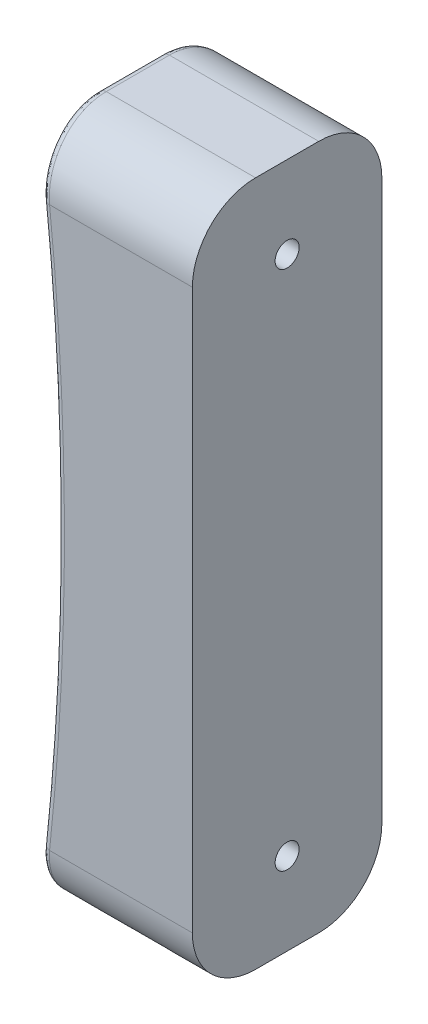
ISO-10303-21;
HEADER;
FILE_DESCRIPTION(('STEP AP214'),'2;1');
FILE_NAME('part.step','',(''),(''),'','','');
FILE_SCHEMA(('AUTOMOTIVE_DESIGN { 1 0 10303 214 1 1 1 1 }'));
ENDSEC;
DATA;
#1=APPLICATION_CONTEXT('core data for automotive mechanical design processes');
#2=APPLICATION_PROTOCOL_DEFINITION('international standard','automotive_design',2000,#1);
#3=PRODUCT_CONTEXT('',#1,'mechanical');
#4=PRODUCT('Part','Part','',(#3));
#5=PRODUCT_RELATED_PRODUCT_CATEGORY('part','',(#4));
#6=PRODUCT_DEFINITION_FORMATION('','',#4);
#7=PRODUCT_DEFINITION_CONTEXT('part definition',#1,'design');
#8=PRODUCT_DEFINITION('design','',#6,#7);
#9=PRODUCT_DEFINITION_SHAPE('','',#8);
#10=(LENGTH_UNIT() NAMED_UNIT(*) SI_UNIT(.MILLI.,.METRE.));
#11=(NAMED_UNIT(*) PLANE_ANGLE_UNIT() SI_UNIT($,.RADIAN.));
#12=(NAMED_UNIT(*) SI_UNIT($,.STERADIAN.) SOLID_ANGLE_UNIT());
#13=UNCERTAINTY_MEASURE_WITH_UNIT(LENGTH_MEASURE(1.E-05),#10,'distance_accuracy_value','');
#14=(GEOMETRIC_REPRESENTATION_CONTEXT(3) GLOBAL_UNCERTAINTY_ASSIGNED_CONTEXT((#13)) GLOBAL_UNIT_ASSIGNED_CONTEXT((#10,
#11,#12)) REPRESENTATION_CONTEXT('',''));
#15=CARTESIAN_POINT('',(0.,0.,0.));
#16=DIRECTION('',(0.,0.,1.));
#17=DIRECTION('',(1.,0.,0.));
#18=AXIS2_PLACEMENT_3D('',#15,#16,#17);
#19=CARTESIAN_POINT('',(-384.656870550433,38.7021057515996,-6.34995127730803));
#20=DIRECTION('',(1.,0.,0.));
#21=DIRECTION('',(0.,0.,-1.));
#22=AXIS2_PLACEMENT_3D('',#19,#20,#21);
#23=CYLINDRICAL_SURFACE('',#22,12.7000487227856);
#24=DIRECTION('',(1.,0.,0.));
#25=VECTOR('',#24,1.);
#26=CARTESIAN_POINT('',(-384.656870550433,38.7020569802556,-19.05));
#27=LINE('',#26,#25);
#28=CARTESIAN_POINT('',(-381.61489539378,38.7020569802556,-19.05));
#29=VERTEX_POINT('',#28);
#30=CARTESIAN_POINT('',(-352.906870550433,38.7020569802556,-19.05));
#31=VERTEX_POINT('',#30);
#32=EDGE_CURVE('E156',#29,#31,#27,.T.);
#33=ORIENTED_EDGE('',*,*,#32,.F.);
#34=CARTESIAN_POINT('',(-382.750066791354,34.8408301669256,-16.8919702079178));
#35=CARTESIAN_POINT('',(-382.701921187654,34.3556586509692,-18.283874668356));
#36=CARTESIAN_POINT('',(-381.233515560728,34.4853104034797,-18.3295119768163));
#37=CARTESIAN_POINT('',(-382.779517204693,35.1376332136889,-16.9967802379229));
#38=CARTESIAN_POINT('',(-382.734888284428,34.6906888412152,-18.4059686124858));
#39=CARTESIAN_POINT('',(-381.263050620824,34.8235558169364,-18.4486142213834));
#40=CARTESIAN_POINT('',(-382.809660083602,35.4388147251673,-17.0888971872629));
#41=CARTESIAN_POINT('',(-382.768652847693,35.030520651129,-18.5137421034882));
#42=CARTESIAN_POINT('',(-381.29328013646,35.1667910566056,-18.553292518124));
#43=CARTESIAN_POINT('',(-382.871138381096,36.0477269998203,-17.2472570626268));
#44=CARTESIAN_POINT('',(-382.837637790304,35.7180461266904,-18.7004606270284));
#45=CARTESIAN_POINT('',(-381.354935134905,35.8607252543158,-18.7332468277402));
#46=CARTESIAN_POINT('',(-382.902473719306,36.3554573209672,-17.3135017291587));
#47=CARTESIAN_POINT('',(-382.872867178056,36.0658131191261,-18.7793489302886));
#48=CARTESIAN_POINT('',(-381.386360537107,36.2114237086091,-18.8085248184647));
#49=CARTESIAN_POINT('',(-382.96612526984,36.9750733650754,-17.4196045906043));
#50=CARTESIAN_POINT('',(-382.944558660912,36.766578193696,-18.907640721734));
#51=CARTESIAN_POINT('',(-381.450195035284,36.9175562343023,-18.9290961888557));
#52=CARTESIAN_POINT('',(-382.998440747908,37.2869558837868,-17.4594820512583));
#53=CARTESIAN_POINT('',(-382.981028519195,37.1196387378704,-18.9569957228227));
#54=CARTESIAN_POINT('',(-381.482603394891,37.2729866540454,-18.9744114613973));
#55=CARTESIAN_POINT('',(-383.063861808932,37.9128801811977,-17.5126790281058));
#56=CARTESIAN_POINT('',(-383.054999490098,37.8288139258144,-19.0259476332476));
#57=CARTESIAN_POINT('',(-381.548212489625,37.9863082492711,-19.0348625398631));
#58=CARTESIAN_POINT('',(-383.096967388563,38.2269219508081,-17.5259986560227));
#59=CARTESIAN_POINT('',(-383.092508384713,38.1849837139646,-19.0454642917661));
#60=CARTESIAN_POINT('',(-381.581413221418,38.3441994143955,-19.0499984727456));
#61=CARTESIAN_POINT('',(-383.163845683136,38.8559306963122,-17.5260013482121));
#62=CARTESIAN_POINT('',(-383.168430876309,38.8990557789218,-19.0545622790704));
#63=CARTESIAN_POINT('',(-381.64848373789,39.0610361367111,-19.0500015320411));
#64=CARTESIAN_POINT('',(-383.197620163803,39.1708974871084,-17.5126007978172));
#65=CARTESIAN_POINT('',(-383.206853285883,39.2569992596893,-19.0439598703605));
#66=CARTESIAN_POINT('',(-381.682355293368,39.4199814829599,-19.0347736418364));
#67=CARTESIAN_POINT('',(-383.265501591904,39.7986499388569,-17.4590942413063));
#68=CARTESIAN_POINT('',(-383.284233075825,39.9711561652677,-18.9926109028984));
#69=CARTESIAN_POINT('',(-381.750431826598,40.1353864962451,-18.9739707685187));
#70=CARTESIAN_POINT('',(-383.299608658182,40.1114347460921,-17.4189783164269));
#71=CARTESIAN_POINT('',(-383.323195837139,40.3273959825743,-18.9517568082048));
#72=CARTESIAN_POINT('',(-381.784636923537,40.4918451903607,-18.9283845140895));
#73=CARTESIAN_POINT('',(-383.367865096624,40.7323243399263,-17.3123476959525));
#74=CARTESIAN_POINT('',(-383.401332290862,41.0353501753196,-18.840112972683));
#75=CARTESIAN_POINT('',(-381.853089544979,41.1994290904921,-18.8072134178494));
#76=CARTESIAN_POINT('',(-383.402014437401,41.0404314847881,-17.2458467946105));
#77=CARTESIAN_POINT('',(-383.440509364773,41.3870778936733,-18.7692387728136));
#78=CARTESIAN_POINT('',(-381.887337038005,41.5505569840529,-18.7316442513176));
#79=CARTESIAN_POINT('',(-383.470113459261,41.6500556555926,-17.0868904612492));
#80=CARTESIAN_POINT('',(-383.518801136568,42.0838621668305,-18.5979145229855));
#81=CARTESIAN_POINT('',(-381.955631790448,42.245302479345,-18.5510121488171));
#82=CARTESIAN_POINT('',(-383.504063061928,41.9515702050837,-16.9944254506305));
#83=CARTESIAN_POINT('',(-383.557917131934,42.4289079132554,-18.4973530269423));
#84=CARTESIAN_POINT('',(-381.989678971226,42.5889172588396,-18.445938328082));
#85=CARTESIAN_POINT('',(-383.571461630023,42.5456873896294,-16.7842103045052));
#86=CARTESIAN_POINT('',(-383.635740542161,43.1096832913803,-18.2672567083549));
#87=CARTESIAN_POINT('',(-382.057271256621,43.2659905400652,-18.2070576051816));
#88=CARTESIAN_POINT('',(-383.604910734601,42.8382925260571,-16.6664673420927));
#89=CARTESIAN_POINT('',(-383.674447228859,43.4453890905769,-18.1376322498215));
#90=CARTESIAN_POINT('',(-382.09081650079,43.5994518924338,-18.0732588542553));
#91=CARTESIAN_POINT('',(-383.671032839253,43.4126259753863,-16.4065152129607));
#92=CARTESIAN_POINT('',(-383.751130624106,44.105226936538,-17.8501771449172));
#93=CARTESIAN_POINT('',(-382.15712865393,44.2539790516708,-17.7778588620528));
#94=CARTESIAN_POINT('',(-383.703705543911,43.6943501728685,-16.2642968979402));
#95=CARTESIAN_POINT('',(-383.78910364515,44.4293075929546,-17.6922453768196));
#96=CARTESIAN_POINT('',(-382.189895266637,44.5750401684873,-17.6162472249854));
#97=CARTESIAN_POINT('',(-383.800095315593,44.519919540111,-15.8024164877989));
#98=CARTESIAN_POINT('',(-383.901559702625,45.3819008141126,-17.176746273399));
#99=CARTESIAN_POINT('',(-382.286562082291,45.5158831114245,-17.0913833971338));
#100=CARTESIAN_POINT('',(-383.862251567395,45.0447547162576,-15.4473184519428));
#101=CARTESIAN_POINT('',(-383.974253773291,45.9879266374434,-16.7784566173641));
#102=CARTESIAN_POINT('',(-382.348896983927,46.1140005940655,-16.6878631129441));
#103=CARTESIAN_POINT('',(-383.979836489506,46.0265279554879,-14.6533989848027));
#104=CARTESIAN_POINT('',(-384.112380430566,47.1251194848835,-15.8836713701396));
#105=CARTESIAN_POINT('',(-382.466819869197,47.2328580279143,-15.7856823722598));
#106=CARTESIAN_POINT('',(-384.035276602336,46.4835818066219,-14.2147233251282));
#107=CARTESIAN_POINT('',(-384.177744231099,47.6556511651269,-15.3869562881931));
#108=CARTESIAN_POINT('',(-382.522419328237,47.7537299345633,-15.2871875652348));
#109=CARTESIAN_POINT('',(-384.111819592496,47.1089380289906,-13.5034067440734));
#110=CARTESIAN_POINT('',(-384.268243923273,48.3828394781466,-14.5794342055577));
#111=CARTESIAN_POINT('',(-382.599182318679,48.4664041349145,-14.4788736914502));
#112=CARTESIAN_POINT('',(-384.136244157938,47.3074571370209,-13.2572480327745));
#113=CARTESIAN_POINT('',(-384.297211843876,48.6142601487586,-14.29908369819));
#114=CARTESIAN_POINT('',(-382.623677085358,48.6926423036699,-14.1991480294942));
#115=CARTESIAN_POINT('',(-384.182646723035,47.6830422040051,-12.7488188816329));
#116=CARTESIAN_POINT('',(-384.352350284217,49.0527067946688,-13.7189974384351));
#117=CARTESIAN_POINT('',(-382.67021302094,49.1206700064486,-13.6213879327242));
#118=CARTESIAN_POINT('',(-384.204625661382,47.8601163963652,-12.4865546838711));
#119=CARTESIAN_POINT('',(-384.37850780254,49.2596245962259,-13.4192897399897));
#120=CARTESIAN_POINT('',(-382.692255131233,49.3224689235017,-13.3233605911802));
#121=CARTESIAN_POINT('',(-384.245797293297,48.1906243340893,-11.9491929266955));
#122=CARTESIAN_POINT('',(-384.427592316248,49.6463441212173,-12.8042314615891));
#123=CARTESIAN_POINT('',(-382.73354509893,49.6991254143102,-12.7127225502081));
#124=CARTESIAN_POINT('',(-384.265004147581,48.3441784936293,-11.6741708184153));
#125=CARTESIAN_POINT('',(-384.450521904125,49.8261712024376,-12.4890147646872));
#126=CARTESIAN_POINT('',(-382.752807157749,49.8741202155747,-12.4001975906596));
#127=CARTESIAN_POINT('',(-384.300561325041,48.6275949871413,-11.1120579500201));
#128=CARTESIAN_POINT('',(-384.493037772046,50.1584839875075,-11.8438413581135));
#129=CARTESIAN_POINT('',(-382.788466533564,50.1971099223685,-11.7614333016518));
#130=CARTESIAN_POINT('',(-384.316912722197,48.7574662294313,-10.8249717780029));
#131=CARTESIAN_POINT('',(-384.512611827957,50.31087211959,-11.5139604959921));
#132=CARTESIAN_POINT('',(-382.804864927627,50.345114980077,-11.4351991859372));
#133=CARTESIAN_POINT('',(-384.346579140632,48.9925215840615,-10.2409081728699));
#134=CARTESIAN_POINT('',(-384.54817425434,50.5869826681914,-10.8420174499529));
#135=CARTESIAN_POINT('',(-382.834616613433,50.6129909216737,-10.7714908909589));
#136=CARTESIAN_POINT('',(-384.359896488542,49.0977246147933,-9.94393852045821));
#137=CARTESIAN_POINT('',(-384.564153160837,50.7106308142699,-10.50005753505));
#138=CARTESIAN_POINT('',(-382.847972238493,50.732883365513,-10.4340255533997));
#139=CARTESIAN_POINT('',(-384.383362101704,49.2827562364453,-9.34213394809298));
#140=CARTESIAN_POINT('',(-384.592341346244,50.928309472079,-9.80637934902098));
#141=CARTESIAN_POINT('',(-382.871505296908,50.9437508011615,-9.75015707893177));
#142=CARTESIAN_POINT('',(-384.393511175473,49.3625913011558,-9.03730105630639));
#143=CARTESIAN_POINT('',(-384.604541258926,51.022267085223,-9.45477649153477));
#144=CARTESIAN_POINT('',(-382.881683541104,51.0347331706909,-9.40375624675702));
#145=CARTESIAN_POINT('',(-384.412817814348,49.5142776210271,-8.33919615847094));
#146=CARTESIAN_POINT('',(-384.627774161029,51.2009519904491,-8.64881447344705));
#147=CARTESIAN_POINT('',(-382.90104567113,51.2075993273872,-8.61045564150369));
#148=CARTESIAN_POINT('',(-384.420978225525,49.5782355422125,-7.94414574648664));
#149=CARTESIAN_POINT('',(-384.637597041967,51.2762940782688,-8.1925767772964));
#150=CARTESIAN_POINT('',(-382.909229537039,51.2804876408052,-8.16153495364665));
#151=CARTESIAN_POINT('',(-384.431874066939,49.6635920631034,-7.14937207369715));
#152=CARTESIAN_POINT('',(-384.650724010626,51.3769251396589,-7.27405578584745));
#153=CARTESIAN_POINT('',(-382.920156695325,51.3777624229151,-7.25838352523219));
#154=CARTESIAN_POINT('',(-384.434609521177,49.6849908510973,-6.74964883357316));
#155=CARTESIAN_POINT('',(-384.65401969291,51.4021496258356,-6.81206382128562));
#156=CARTESIAN_POINT('',(-382.922900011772,51.402149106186,-6.80415280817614));
#157=CARTESIAN_POINT('',(-384.434610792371,49.6849992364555,-6.03819257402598));
#158=CARTESIAN_POINT('',(-384.654021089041,51.4021582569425,-5.98950969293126));
#159=CARTESIAN_POINT('',(-382.922901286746,51.4021586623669,-5.99568020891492));
#160=CARTESIAN_POINT('',(-384.432946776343,49.6719808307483,-5.72643272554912));
#161=CARTESIAN_POINT('',(-384.652016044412,51.3868104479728,-5.62913808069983));
#162=CARTESIAN_POINT('',(-382.921232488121,51.3873225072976,-5.64140783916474));
#163=CARTESIAN_POINT('',(-384.426310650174,49.6200140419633,-5.1051382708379));
#164=CARTESIAN_POINT('',(-384.644019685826,51.3255365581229,-4.91099790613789));
#165=CARTESIAN_POINT('',(-382.91457728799,51.3280996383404,-4.93539178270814));
#166=CARTESIAN_POINT('',(-384.421338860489,49.5810681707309,-4.79560345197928));
#167=CARTESIAN_POINT('',(-384.638031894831,51.2796374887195,-4.55336886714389));
#168=CARTESIAN_POINT('',(-382.90959120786,51.283715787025,-4.5836478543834));
#169=CARTESIAN_POINT('',(-384.408112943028,49.4773164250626,-4.17971851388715));
#170=CARTESIAN_POINT('',(-384.62210789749,51.157377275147,-3.84199015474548));
#171=CARTESIAN_POINT('',(-382.896327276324,51.1654772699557,-3.88377897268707));
#172=CARTESIAN_POINT('',(-384.399845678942,49.4124070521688,-3.8733862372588));
#173=CARTESIAN_POINT('',(-384.612162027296,51.0809414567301,-3.48839392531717));
#174=CARTESIAN_POINT('',(-382.888036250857,51.0915046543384,-3.53567429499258));
#175=CARTESIAN_POINT('',(-384.38012362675,49.2572280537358,-3.26724317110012));
#176=CARTESIAN_POINT('',(-384.588447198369,50.8982478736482,-2.78910504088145));
#177=CARTESIAN_POINT('',(-382.868257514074,50.9146581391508,-2.84687571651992));
#178=CARTESIAN_POINT('',(-384.368667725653,49.1669495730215,-2.96743469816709));
#179=CARTESIAN_POINT('',(-384.574685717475,50.7920480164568,-2.44353503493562));
#180=CARTESIAN_POINT('',(-382.856768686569,50.8117741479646,-2.50618444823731));
#181=CARTESIAN_POINT('',(-384.355667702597,49.0642586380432,-2.67202812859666));
#182=CARTESIAN_POINT('',(-384.559071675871,50.6712303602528,-2.10302308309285));
#183=CARTESIAN_POINT('',(-382.843731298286,50.6947445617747,-2.17049534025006));
#184=(BOUNDED_SURFACE() B_SPLINE_SURFACE(3,2,((#34,#35,#36),(#37,#38,#39),(#40,#41,#42),(#43,
#44,#45),(#46,#47,#48),(#49,#50,#51),(#52,#53,#54),(#55,#56,#57),(#58,#59,#60),(#61,#62,#63),
(#64,#65,#66),(#67,#68,#69),(#70,#71,#72),(#73,#74,#75),(#76,#77,#78),(#79,#80,#81),(#82,#83,
#84),(#85,#86,#87),(#88,#89,#90),(#91,#92,#93),(#94,#95,#96),(#97,#98,#99),(#100,#101,#102),
(#103,#104,#105),(#106,#107,#108),(#109,#110,#111),(#112,#113,#114),(#115,#116,#117),(#118,#119,
#120),(#121,#122,#123),(#124,#125,#126),(#127,#128,#129),(#130,#131,#132),(#133,#134,#135),
(#136,#137,#138),(#139,#140,#141),(#142,#143,#144),(#145,#146,#147),(#148,#149,#150),(#151,#152,
#153),(#154,#155,#156),(#157,#158,#159),(#160,#161,#162),(#163,#164,#165),(#166,#167,#168),
(#169,#170,#171),(#172,#173,#174),(#175,#176,#177),(#178,#179,#180),(#181,#182,#183)),
.UNSPECIFIED.,.F.,.F.,.F.) B_SPLINE_SURFACE_WITH_KNOTS((4,2,2,2,2,2,2,2,2,2,2,2,2,2,2,2,2,2,2,2,
2,2,2,2,4),(3,3),(0.,0.950552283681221,1.90104060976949,2.85083367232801,3.80062273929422,
4.75338861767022,5.70650843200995,6.65913060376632,7.61210467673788,8.56480868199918,
9.51786956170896,11.422111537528,13.3230621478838,14.2747193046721,15.2260099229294,
16.1722545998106,17.1181426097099,18.0633028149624,19.008221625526,20.2067431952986,
21.4052594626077,22.3403148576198,23.2752796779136,24.2140093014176,25.153066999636),(0.,1.),
.UNSPECIFIED.) GEOMETRIC_REPRESENTATION_ITEM() RATIONAL_B_SPLINE_SURFACE(((1.,0.718605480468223,
1.),(1.,0.717755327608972,1.),(1.,0.716875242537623,1.),(1.,0.715059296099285,1.),(1.,
0.71412343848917,1.),(1.,0.712200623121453,1.),(1.,0.711213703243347,1.),(1.,0.709193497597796,
1.),(1.,0.70816021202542,1.),(1.,0.706050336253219,1.),(1.,0.704973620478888,1.),(1.,
0.702787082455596,1.),(1.,0.701677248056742,1.),(1.,0.699434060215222,1.),(1.,0.698300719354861,
1.),(1.,0.696019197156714,1.),(1.,0.694871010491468,1.),(1.,0.692571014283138,1.),(1.,
0.691419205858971,1.),(1.,0.689122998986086,1.),(1.,0.687978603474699,1.),(1.,0.684575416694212,
1.),(1.,0.682344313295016,1.),(1.,0.67806671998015,1.),(1.,0.676019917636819,1.),(1.,
0.673163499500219,1.),(1.,0.672246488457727,1.),(1.,0.670495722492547,1.),(1.,0.669661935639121,
1.),(1.,0.668093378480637,1.),(1.,0.667358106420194,1.),(1.,0.665992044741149,1.),(1.,
0.665361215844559,1.),(1.,0.664213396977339,1.),(1.,0.663696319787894,1.),(1.,0.662783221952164,
1.),(1.,0.662387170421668,1.),(1.,0.661632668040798,1.),(1.,0.661312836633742,1.),(1.,
0.660885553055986,1.),(1.,0.66077809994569,1.),(1.,0.660778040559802,1.),(1.,0.660843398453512,
1.),(1.,0.661103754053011,1.),(1.,0.661298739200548,1.),(1.,0.661816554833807,1.),(1.,
0.662139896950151,1.),(1.,0.66290928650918,1.),(1.,0.663355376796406,1.),(1.,0.663860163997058,1.))) REPRESENTATION_ITEM('') SURFACE());
#185=CARTESIAN_POINT('',(-381.233515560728,34.4853104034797,-18.3295119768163));
#186=CARTESIAN_POINT('',(-381.263050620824,34.8235558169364,-18.4486142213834));
#187=CARTESIAN_POINT('',(-381.29328013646,35.1667910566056,-18.553292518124));
#188=CARTESIAN_POINT('',(-381.354935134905,35.8607252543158,-18.7332468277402));
#189=CARTESIAN_POINT('',(-381.386360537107,36.2114237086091,-18.8085248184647));
#190=CARTESIAN_POINT('',(-381.450195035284,36.9175562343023,-18.9290961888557));
#191=CARTESIAN_POINT('',(-381.482603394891,37.2729866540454,-18.9744114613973));
#192=CARTESIAN_POINT('',(-381.548212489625,37.9863082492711,-19.0348625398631));
#193=CARTESIAN_POINT('',(-381.581413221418,38.3441994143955,-19.0499984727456));
#194=CARTESIAN_POINT('',(-381.64848373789,39.0610361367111,-19.0500015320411));
#195=CARTESIAN_POINT('',(-381.682355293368,39.4199814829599,-19.0347736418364));
#196=CARTESIAN_POINT('',(-381.750431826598,40.1353864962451,-18.9739707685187));
#197=CARTESIAN_POINT('',(-381.784636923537,40.4918451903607,-18.9283845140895));
#198=CARTESIAN_POINT('',(-381.853089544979,41.1994290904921,-18.8072134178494));
#199=CARTESIAN_POINT('',(-381.887337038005,41.5505569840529,-18.7316442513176));
#200=CARTESIAN_POINT('',(-381.955631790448,42.245302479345,-18.5510121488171));
#201=CARTESIAN_POINT('',(-381.989678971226,42.5889172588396,-18.445938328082));
#202=CARTESIAN_POINT('',(-382.057271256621,43.2659905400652,-18.2070576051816));
#203=CARTESIAN_POINT('',(-382.09081650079,43.5994518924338,-18.0732588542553));
#204=CARTESIAN_POINT('',(-382.15712865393,44.2539790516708,-17.7778588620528));
#205=CARTESIAN_POINT('',(-382.189895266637,44.5750401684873,-17.6162472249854));
#206=CARTESIAN_POINT('',(-382.286562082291,45.5158831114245,-17.0913833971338));
#207=CARTESIAN_POINT('',(-382.348896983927,46.1140005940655,-16.6878631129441));
#208=CARTESIAN_POINT('',(-382.466819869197,47.2328580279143,-15.7856823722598));
#209=CARTESIAN_POINT('',(-382.522419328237,47.7537299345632,-15.2871875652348));
#210=CARTESIAN_POINT('',(-382.599182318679,48.4664041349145,-14.4788736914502));
#211=CARTESIAN_POINT('',(-382.623677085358,48.6926423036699,-14.1991480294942));
#212=CARTESIAN_POINT('',(-382.67021302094,49.1206700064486,-13.6213879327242));
#213=CARTESIAN_POINT('',(-382.692255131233,49.3224689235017,-13.3233605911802));
#214=CARTESIAN_POINT('',(-382.73354509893,49.6991254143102,-12.7127225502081));
#215=CARTESIAN_POINT('',(-382.752807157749,49.8741202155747,-12.4001975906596));
#216=CARTESIAN_POINT('',(-382.788466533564,50.1971099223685,-11.7614333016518));
#217=CARTESIAN_POINT('',(-382.804864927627,50.345114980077,-11.4351991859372));
#218=CARTESIAN_POINT('',(-382.834616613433,50.6129909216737,-10.7714908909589));
#219=CARTESIAN_POINT('',(-382.847972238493,50.732883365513,-10.4340255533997));
#220=CARTESIAN_POINT('',(-382.871505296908,50.9437508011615,-9.75015707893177));
#221=CARTESIAN_POINT('',(-382.881683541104,51.0347331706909,-9.40375624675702));
#222=CARTESIAN_POINT('',(-382.90104567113,51.2075993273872,-8.61045564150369));
#223=CARTESIAN_POINT('',(-382.909229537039,51.2804876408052,-8.16153495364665));
#224=CARTESIAN_POINT('',(-382.920156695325,51.3777624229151,-7.25838352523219));
#225=CARTESIAN_POINT('',(-382.922900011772,51.402149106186,-6.80415280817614));
#226=CARTESIAN_POINT('',(-382.922901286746,51.4021586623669,-5.99568020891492));
#227=CARTESIAN_POINT('',(-382.921232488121,51.3873225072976,-5.64140783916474));
#228=CARTESIAN_POINT('',(-382.91457728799,51.3280996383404,-4.93539178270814));
#229=CARTESIAN_POINT('',(-382.90959120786,51.283715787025,-4.5836478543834));
#230=CARTESIAN_POINT('',(-382.896327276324,51.1654772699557,-3.88377897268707));
#231=CARTESIAN_POINT('',(-382.888036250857,51.0915046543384,-3.53567429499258));
#232=CARTESIAN_POINT('',(-382.868257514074,50.9146581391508,-2.84687571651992));
#233=CARTESIAN_POINT('',(-382.856768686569,50.8117741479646,-2.50618444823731));
#234=CARTESIAN_POINT('',(-382.843731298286,50.6947445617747,-2.17049534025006));
#235=B_SPLINE_CURVE_WITH_KNOTS('',3,(#185,#186,#187,#188,#189,#190,#191,#192,#193,#194,#195,
#196,#197,#198,#199,#200,#201,#202,#203,#204,#205,#206,#207,#208,#209,#210,#211,#212,#213,#214,
#215,#216,#217,#218,#219,#220,#221,#222,#223,#224,#225,#226,#227,#228,#229,#230,#231,#232,#233,
#234),.UNSPECIFIED.,.F.,.F.,(4,2,2,2,2,2,2,2,2,2,2,2,2,2,2,2,2,2,2,2,2,2,2,2,4),(0.,
0.950552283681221,1.90104060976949,2.85083367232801,3.80062273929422,4.75338861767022,
5.70650843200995,6.65913060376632,7.61210467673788,8.56480868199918,9.51786956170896,
11.422111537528,13.3230621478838,14.2747193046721,15.2260099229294,16.1722545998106,
17.1181426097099,18.0633028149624,19.008221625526,20.2067431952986,21.4052594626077,
22.3403148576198,23.2752796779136,24.2140093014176,25.153066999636),.UNSPECIFIED.);
#236=CARTESIAN_POINT('',(-382.922900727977,51.4021544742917,-6.34999999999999));
#237=VERTEX_POINT('',#236);
#238=EDGE_CURVE('E167',#29,#237,#235,.T.);
#239=ORIENTED_EDGE('',*,*,#238,.T.);
#240=DIRECTION('',(1.,0.,0.));
#241=VECTOR('',#240,1.);
#242=CARTESIAN_POINT('',(-384.656870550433,51.4021544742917,-6.34999999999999));
#243=LINE('',#242,#241);
#244=CARTESIAN_POINT('',(-352.906870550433,51.4021544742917,-6.34999999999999));
#245=VERTEX_POINT('',#244);
#246=EDGE_CURVE('E180',#237,#245,#243,.T.);
#247=ORIENTED_EDGE('',*,*,#246,.T.);
#248=CARTESIAN_POINT('',(-352.906870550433,38.7021057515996,-6.34995127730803));
#249=DIRECTION('',(-1.,0.,0.));
#250=DIRECTION('',(0.,0.,1.));
#251=AXIS2_PLACEMENT_3D('',#248,#249,#250);
#252=CIRCLE('',#251,12.7000487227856);
#253=EDGE_CURVE('E174',#245,#31,#252,.T.);
#254=ORIENTED_EDGE('',*,*,#253,.T.);
#255=EDGE_LOOP('',(#33,#239,#247,#254));
#256=FACE_BOUND('',#255,.T.);
#257=ADVANCED_FACE('F66',(#256),#23,.T.);
#258=CARTESIAN_POINT('',(-384.656870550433,38.7020569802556,-19.05));
#259=DIRECTION('',(0.,0.,1.));
#260=DIRECTION('',(1.,0.,0.));
#261=AXIS2_PLACEMENT_3D('',#258,#259,#260);
#262=PLANE('',#261);
#263=DIRECTION('',(1.,0.,0.));
#264=VECTOR('',#263,1.);
#265=CARTESIAN_POINT('',(-384.656870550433,-73.7327308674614,-19.05));
#266=LINE('',#265,#264);
#267=CARTESIAN_POINT('',(-381.614053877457,-73.7327308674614,-19.05));
#268=VERTEX_POINT('',#267);
#269=CARTESIAN_POINT('',(-352.906870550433,-73.7327308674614,-19.05));
#270=VERTEX_POINT('',#269);
#271=EDGE_CURVE('E168',#268,#270,#266,.T.);
#272=ORIENTED_EDGE('',*,*,#271,.F.);
#273=CARTESIAN_POINT('',(-910.392034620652,-17.5192945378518,-19.05));
#274=DIRECTION('',(0.,0.,1.));
#275=DIRECTION('',(1.,0.,0.));
#276=AXIS2_PLACEMENT_3D('',#273,#274,#275);
#277=CIRCLE('',#276,531.757560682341);
#278=EDGE_CURVE('E162',#268,#29,#277,.T.);
#279=ORIENTED_EDGE('',*,*,#278,.T.);
#280=ORIENTED_EDGE('',*,*,#32,.T.);
#281=DIRECTION('',(0.,-1.,0.));
#282=VECTOR('',#281,1.);
#283=CARTESIAN_POINT('',(-352.906870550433,38.7020569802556,-19.05));
#284=LINE('',#283,#282);
#285=EDGE_CURVE('E159',#31,#270,#284,.T.);
#286=ORIENTED_EDGE('',*,*,#285,.T.);
#287=EDGE_LOOP('',(#272,#279,#280,#286));
#288=FACE_BOUND('',#287,.T.);
#289=ADVANCED_FACE('F158',(#288),#262,.F.);
#290=CARTESIAN_POINT('',(-384.656870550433,-73.7327308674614,-6.35));
#291=DIRECTION('',(-1.,0.,0.));
#292=DIRECTION('',(0.,1.,0.));
#293=AXIS2_PLACEMENT_3D('',#290,#291,#292);
#294=ELLIPSE('',#293,12.708012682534,12.7);
#295=DIRECTION('',(1.,0.,0.));
#296=VECTOR('',#295,1.);
#297=SURFACE_OF_LINEAR_EXTRUSION('',#294,#296);
#298=DIRECTION('',(1.,0.,0.));
#299=VECTOR('',#298,1.);
#300=CARTESIAN_POINT('',(-384.656870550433,-86.4407435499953,-6.35));
#301=LINE('',#300,#299);
#302=CARTESIAN_POINT('',(-382.922900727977,-86.4407435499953,-6.35));
#303=VERTEX_POINT('',#302);
#304=CARTESIAN_POINT('',(-352.906870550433,-86.4407435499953,-6.35));
#305=VERTEX_POINT('',#304);
#306=EDGE_CURVE('E214',#303,#305,#301,.T.);
#307=ORIENTED_EDGE('',*,*,#306,.F.);
#308=CARTESIAN_POINT('',(-384.355697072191,-84.1030797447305,-2.67403276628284));
#309=CARTESIAN_POINT('',(-384.559098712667,-85.7100273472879,-2.10496503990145));
#310=CARTESIAN_POINT('',(-382.843760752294,-85.7335468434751,-2.17244405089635));
#311=CARTESIAN_POINT('',(-384.368667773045,-84.2055387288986,-2.9687331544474));
#312=CARTESIAN_POINT('',(-384.574678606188,-85.8305806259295,-2.44468405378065));
#313=CARTESIAN_POINT('',(-382.856768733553,-85.8503189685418,-2.50735024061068));
#314=CARTESIAN_POINT('',(-384.38010089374,-84.295637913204,-3.26781979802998));
#315=CARTESIAN_POINT('',(-384.588413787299,-85.9365780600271,-2.78944640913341));
#316=CARTESIAN_POINT('',(-382.868234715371,-85.9530053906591,-2.84724345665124));
#317=CARTESIAN_POINT('',(-384.399793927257,-84.4505893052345,-3.87259205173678));
#318=CARTESIAN_POINT('',(-384.61209566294,-86.1190191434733,-3.48720650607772));
#319=CARTESIAN_POINT('',(-382.88798435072,-86.1296049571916,-3.5345328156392));
#320=CARTESIAN_POINT('',(-384.408053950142,-84.5154423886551,-4.17827743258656));
#321=CARTESIAN_POINT('',(-384.622033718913,-86.1953958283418,-3.84008475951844));
#322=CARTESIAN_POINT('',(-382.89626811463,-86.2035190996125,-3.88192869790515));
#323=CARTESIAN_POINT('',(-384.421298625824,-84.6193419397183,-4.79386066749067));
#324=CARTESIAN_POINT('',(-384.637981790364,-86.3178420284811,-4.55117653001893));
#325=CARTESIAN_POINT('',(-382.909550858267,-86.3219354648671,-4.5815102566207));
#326=CARTESIAN_POINT('',(-384.426285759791,-84.6584079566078,-5.10375514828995));
#327=CARTESIAN_POINT('',(-384.643988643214,-86.363887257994,-4.90925354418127));
#328=CARTESIAN_POINT('',(-382.914552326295,-86.3664599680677,-4.93369209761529));
#329=CARTESIAN_POINT('',(-384.432941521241,-84.710529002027,-5.72576639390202));
#330=CARTESIAN_POINT('',(-384.652009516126,-86.4253497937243,-5.62829013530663));
#331=CARTESIAN_POINT('',(-382.921227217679,-86.4258636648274,-5.64058259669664));
#332=CARTESIAN_POINT('',(-384.4346102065,-84.7235844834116,-6.03788311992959));
#333=CARTESIAN_POINT('',(-384.654020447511,-86.440743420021,-5.98910921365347));
#334=CARTESIAN_POINT('',(-382.922900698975,-86.4407433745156,-5.99529121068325));
#335=CARTESIAN_POINT('',(-384.434610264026,-84.7235847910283,-6.66221628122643));
#336=CARTESIAN_POINT('',(-384.654020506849,-86.4407436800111,-6.71100572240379));
#337=CARTESIAN_POINT('',(-382.922900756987,-86.440743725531,-6.70482175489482));
#338=CARTESIAN_POINT('',(-384.432940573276,-84.7105213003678,-6.97443271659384));
#339=CARTESIAN_POINT('',(-384.652008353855,-86.4253405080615,-7.07193983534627));
#340=CARTESIAN_POINT('',(-382.92122626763,-86.4258548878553,-7.05964368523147));
#341=CARTESIAN_POINT('',(-384.426279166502,-84.6583566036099,-7.59675034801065));
#342=CARTESIAN_POINT('',(-384.643980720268,-86.3638269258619,-7.79133080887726));
#343=CARTESIAN_POINT('',(-382.914545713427,-86.3664014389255,-7.76688237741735));
#344=CARTESIAN_POINT('',(-384.421286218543,-84.6192457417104,-7.9068507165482));
#345=CARTESIAN_POINT('',(-384.637966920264,-86.3177293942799,-8.14964602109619));
#346=CARTESIAN_POINT('',(-382.909538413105,-86.3218258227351,-8.11929819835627));
#347=CARTESIAN_POINT('',(-384.408035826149,-84.515299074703,-8.5224299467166));
#348=CARTESIAN_POINT('',(-384.622011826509,-86.1952262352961,-8.86073145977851));
#349=CARTESIAN_POINT('',(-382.896249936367,-86.2033557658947,-8.81887520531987));
#350=CARTESIAN_POINT('',(-384.399780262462,-84.4504780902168,-8.82791136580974));
#351=CARTESIAN_POINT('',(-384.61207894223,-86.1188853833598,-9.21337219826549));
#352=CARTESIAN_POINT('',(-382.887970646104,-86.1294782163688,-9.16603929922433));
#353=CARTESIAN_POINT('',(-384.380091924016,-84.29557104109,-9.43237172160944));
#354=CARTESIAN_POINT('',(-384.588403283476,-85.9365020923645,-9.91077696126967));
#355=CARTESIAN_POINT('',(-382.868225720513,-85.952929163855,-9.85297418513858));
#356=CARTESIAN_POINT('',(-384.368657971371,-84.2054756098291,-9.73134820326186));
#357=CARTESIAN_POINT('',(-384.574667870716,-85.830516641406,-10.25541880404));
#358=CARTESIAN_POINT('',(-382.856758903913,-85.8502469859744,-10.1927421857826));
#359=CARTESIAN_POINT('',(-384.342743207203,-84.0007394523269,-10.3204263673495));
#360=CARTESIAN_POINT('',(-384.543561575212,-85.5897858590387,-10.9339526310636));
#361=CARTESIAN_POINT('',(-382.830769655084,-85.6169100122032,-10.8621880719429));
#362=CARTESIAN_POINT('',(-384.32826405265,-83.8861120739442,-10.610532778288));
#363=CARTESIAN_POINT('',(-384.526203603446,-85.4551417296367,-11.2677480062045));
#364=CARTESIAN_POINT('',(-382.816248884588,-85.4862704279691,-11.1918713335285));
#365=CARTESIAN_POINT('',(-384.296412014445,-83.6331429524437,-11.1800320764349));
#366=CARTESIAN_POINT('',(-384.488057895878,-85.1581892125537,-11.9223530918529));
#367=CARTESIAN_POINT('',(-382.784305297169,-85.1979667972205,-11.8390576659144));
#368=CARTESIAN_POINT('',(-384.279038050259,-83.4947923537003,-11.459420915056));
#369=CARTESIAN_POINT('',(-384.467281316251,-84.9959690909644,-12.243077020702));
#370=CARTESIAN_POINT('',(-382.766881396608,-85.0402926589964,-12.1565561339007));
#371=CARTESIAN_POINT('',(-384.222846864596,-83.0456717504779,-12.2783421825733));
#372=CARTESIAN_POINT('',(-384.400240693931,-84.4703457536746,-13.1810230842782));
#373=CARTESIAN_POINT('',(-382.7105287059,-84.5284480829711,-13.0871727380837));
#374=CARTESIAN_POINT('',(-384.17993571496,-82.7006398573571,-12.7991826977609));
#375=CARTESIAN_POINT('',(-384.349174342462,-84.0672856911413,-13.7763179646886));
#376=CARTESIAN_POINT('',(-382.66749422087,-84.1352354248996,-13.6790409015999));
#377=CARTESIAN_POINT('',(-384.084782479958,-81.9278067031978,-13.7774251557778));
#378=CARTESIAN_POINT('',(-384.236259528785,-83.1659482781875,-14.8909360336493));
#379=CARTESIAN_POINT('',(-382.572067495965,-83.2545036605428,-14.7906651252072));
#380=CARTESIAN_POINT('',(-384.032502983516,-81.4996729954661,-14.2345591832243));
#381=CARTESIAN_POINT('',(-384.174474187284,-82.6681861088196,-15.4098618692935));
#382=CARTESIAN_POINT('',(-382.519637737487,-82.7666057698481,-15.310116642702));
#383=CARTESIAN_POINT('',(-383.948778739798,-80.8058000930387,-14.8612659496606));
#384=CARTESIAN_POINT('',(-384.075724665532,-81.861918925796,-16.1193404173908));
#385=CARTESIAN_POINT('',(-382.435672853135,-81.975892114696,-16.0222432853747));
#386=CARTESIAN_POINT('',(-383.919967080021,-80.5657330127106,-15.0604404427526));
#387=CARTESIAN_POINT('',(-384.041864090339,-81.5837906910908,-16.3439820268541));
#388=CARTESIAN_POINT('',(-382.406778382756,-81.7023228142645,-16.2485625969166));
#389=CARTESIAN_POINT('',(-383.860836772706,-80.0699841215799,-15.437860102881));
#390=CARTESIAN_POINT('',(-383.972509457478,-81.0101567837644,-16.7685945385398));
#391=CARTESIAN_POINT('',(-382.347478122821,-81.1373964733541,-16.6774152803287));
#392=CARTESIAN_POINT('',(-383.830518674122,-79.8143079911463,-15.6161128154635));
#393=CARTESIAN_POINT('',(-383.937025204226,-80.7147456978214,-16.9686264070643));
#394=CARTESIAN_POINT('',(-382.317072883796,-80.8460459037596,-16.879957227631));
#395=CARTESIAN_POINT('',(-383.768379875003,-79.2868126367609,-15.9519575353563));
#396=CARTESIAN_POINT('',(-383.864447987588,-80.1060490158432,-17.3444023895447));
#397=CARTESIAN_POINT('',(-382.25475548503,-80.2449552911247,-17.2615616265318));
#398=CARTESIAN_POINT('',(-383.736548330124,-79.01487152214,-16.1093546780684));
#399=CARTESIAN_POINT('',(-383.827349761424,-79.7926950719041,-17.5199935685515));
#400=CARTESIAN_POINT('',(-382.222832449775,-79.935076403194,-17.4404026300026));
#401=CARTESIAN_POINT('',(-383.671929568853,-78.4589210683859,-16.4005210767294));
#402=CARTESIAN_POINT('',(-383.752199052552,-79.1529010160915,-17.8436590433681));
#403=CARTESIAN_POINT('',(-382.1580279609,-79.3015726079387,-17.7712349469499));
#404=CARTESIAN_POINT('',(-383.639142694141,-78.1749160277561,-16.5342986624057));
#405=CARTESIAN_POINT('',(-383.714151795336,-78.8265234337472,-17.9918258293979));
#406=CARTESIAN_POINT('',(-382.125146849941,-78.9779525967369,-17.923235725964));
#407=CARTESIAN_POINT('',(-383.572907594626,-77.5969177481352,-16.7773024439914));
#408=CARTESIAN_POINT('',(-383.637454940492,-78.1631322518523,-18.2597352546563));
#409=CARTESIAN_POINT('',(-382.058721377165,-78.3193363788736,-18.1993395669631));
#410=CARTESIAN_POINT('',(-383.539459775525,-77.3029305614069,-16.8865432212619));
#411=CARTESIAN_POINT('',(-383.598808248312,-77.8261648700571,-18.3795863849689));
#412=CARTESIAN_POINT('',(-382.025177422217,-77.9843470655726,-18.3234591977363));
#413=CARTESIAN_POINT('',(-383.472176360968,-76.7069774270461,-17.0798011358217));
#414=CARTESIAN_POINT('',(-383.521234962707,-77.1439361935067,-18.5902472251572));
#415=CARTESIAN_POINT('',(-381.957700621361,-77.3052812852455,-18.5430380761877));
#416=CARTESIAN_POINT('',(-383.438340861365,-76.4050134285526,-17.1638243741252));
#417=CARTESIAN_POINT('',(-383.482308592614,-76.7986973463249,-18.6811609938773));
#418=CARTESIAN_POINT('',(-381.923767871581,-76.9612070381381,-18.6385042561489));
#419=CARTESIAN_POINT('',(-383.358410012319,-75.6859575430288,-17.3315614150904));
#420=CARTESIAN_POINT('',(-383.390602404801,-75.9780548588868,-18.8606276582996));
#421=CARTESIAN_POINT('',(-381.84360728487,-76.1418795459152,-18.8290842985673));
#422=CARTESIAN_POINT('',(-383.312257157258,-75.2663087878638,-17.4044208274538));
#423=CARTESIAN_POINT('',(-383.337770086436,-75.499613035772,-18.9370661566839));
#424=CARTESIAN_POINT('',(-381.797321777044,-75.6637142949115,-18.9118652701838));
#425=CARTESIAN_POINT('',(-383.220399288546,-74.4216331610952,-17.5016255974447));
#426=CARTESIAN_POINT('',(-383.232923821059,-74.5380946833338,-19.0346894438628));
#427=CARTESIAN_POINT('',(-381.705199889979,-74.7012590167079,-19.0223066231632));
#428=CARTESIAN_POINT('',(-383.174694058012,-73.9966091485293,-17.5259957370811));
#429=CARTESIAN_POINT('',(-383.180898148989,-74.0549679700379,-19.0561425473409));
#430=CARTESIAN_POINT('',(-381.659363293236,-74.2169722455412,-19.0499951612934));
#431=CARTESIAN_POINT('',(-383.096143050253,-73.2577145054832,-17.526003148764));
#432=CARTESIAN_POINT('',(-383.091693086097,-73.215855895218,-19.0454787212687));
#433=CARTESIAN_POINT('',(-381.580586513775,-73.375050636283,-19.050003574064));
#434=CARTESIAN_POINT('',(-383.063058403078,-72.9438257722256,-17.5127125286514));
#435=CARTESIAN_POINT('',(-383.054214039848,-72.8599182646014,-19.0260063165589));
#436=CARTESIAN_POINT('',(-381.547406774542,-73.0173951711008,-19.0349032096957));
#437=CARTESIAN_POINT('',(-382.997665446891,-72.3180828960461,-17.4596286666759));
#438=CARTESIAN_POINT('',(-382.980286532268,-72.1510627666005,-18.9572080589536));
#439=CARTESIAN_POINT('',(-381.481825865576,-72.3044012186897,-18.9745908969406));
#440=CARTESIAN_POINT('',(-382.965357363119,-72.0062293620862,-17.4198278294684));
#441=CARTESIAN_POINT('',(-382.943830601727,-71.7980907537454,-18.9079537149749));
#442=CARTESIAN_POINT('',(-381.449424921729,-71.9490634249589,-18.9293703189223));
#443=CARTESIAN_POINT('',(-382.901622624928,-71.3857182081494,-17.3137578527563));
#444=CARTESIAN_POINT('',(-382.872056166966,-71.096422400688,-18.7797183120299));
#445=CARTESIAN_POINT('',(-381.385506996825,-71.2420268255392,-18.8088560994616));
#446=CARTESIAN_POINT('',(-382.870199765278,-71.0770771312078,-17.2473892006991));
#447=CARTESIAN_POINT('',(-382.836733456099,-70.747677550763,-18.7006954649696));
#448=CARTESIAN_POINT('',(-381.353993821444,-70.8903468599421,-18.7334493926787));
#449=CARTESIAN_POINT('',(-382.808560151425,-70.4664495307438,-17.0886839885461));
#450=CARTESIAN_POINT('',(-382.767577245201,-70.0583134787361,-18.5136025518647));
#451=CARTESIAN_POINT('',(-381.292177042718,-70.1945658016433,-18.5531306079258));
#452=CARTESIAN_POINT('',(-382.778343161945,-70.1644617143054,-16.9963525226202));
#453=CARTESIAN_POINT('',(-382.733734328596,-69.7176187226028,-18.4055972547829));
#454=CARTESIAN_POINT('',(-381.26187320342,-69.8504632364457,-18.4482243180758));
#455=CARTESIAN_POINT('',(-382.748821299,-69.8668666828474,-16.8912761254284));
#456=CARTESIAN_POINT('',(-382.700691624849,-69.3817382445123,-18.283213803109));
#457=CARTESIAN_POINT('',(-381.232266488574,-69.5113636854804,-18.3288364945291));
#458=(BOUNDED_SURFACE() B_SPLINE_SURFACE(3,2,((#308,#309,#310),(#311,#312,#313),(#314,#315,
#316),(#317,#318,#319),(#320,#321,#322),(#323,#324,#325),(#326,#327,#328),(#329,#330,#331),
(#332,#333,#334),(#335,#336,#337),(#338,#339,#340),(#341,#342,#343),(#344,#345,#346),(#347,#348,
#349),(#350,#351,#352),(#353,#354,#355),(#356,#357,#358),(#359,#360,#361),(#362,#363,#364),
(#365,#366,#367),(#368,#369,#370),(#371,#372,#373),(#374,#375,#376),(#377,#378,#379),(#380,#381,
#382),(#383,#384,#385),(#386,#387,#388),(#389,#390,#391),(#392,#393,#394),(#395,#396,#397),
(#398,#399,#400),(#401,#402,#403),(#404,#405,#406),(#407,#408,#409),(#410,#411,#412),(#413,#414,
#415),(#416,#417,#418),(#419,#420,#421),(#422,#423,#424),(#425,#426,#427),(#428,#429,#430),
(#431,#432,#433),(#434,#435,#436),(#437,#438,#439),(#440,#441,#442),(#443,#444,#445),(#446,#447,
#448),(#449,#450,#451),(#452,#453,#454),(#455,#456,#457)),.UNSPECIFIED.,.F.,.F.,
.F.) B_SPLINE_SURFACE_WITH_KNOTS((4,2,2,2,2,2,2,2,2,2,2,2,2,2,2,2,2,2,2,2,2,2,2,2,4),(3,3),(0.,
0.936832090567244,1.87363168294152,2.80972026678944,3.74579255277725,4.68216295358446,
5.61888066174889,6.55505918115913,7.49158510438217,8.4276027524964,9.3639705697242,
11.2349682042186,13.1136110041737,14.0540933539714,14.9942354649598,15.9426210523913,
16.8906715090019,17.8381570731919,18.7854132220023,20.0713929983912,21.3567153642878,
22.3061063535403,23.2557694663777,24.2090234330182,25.1620904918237),(0.,1.),
.UNSPECIFIED.) GEOMETRIC_REPRESENTATION_ITEM() RATIONAL_B_SPLINE_SURFACE(((1.,0.663860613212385,
1.),(1.,0.66335675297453,1.),(1.,0.662911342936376,1.),(1.,0.662142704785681,1.),(1.,
0.661819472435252,1.),(1.,0.661300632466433,1.),(1.,0.661104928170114,1.),(1.,0.660843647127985,
1.),(1.,0.660778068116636,1.),(1.,0.660778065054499,1.),(1.,0.660843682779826,1.),(1.,
0.661105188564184,1.),(1.,0.661301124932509,1.),(1.,0.66182017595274,1.),(1.,0.662143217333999,
1.),(1.,0.662911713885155,1.),(1.,0.663357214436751,1.),(1.,0.664363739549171,1.),(1.,
0.66492470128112,1.),(1.,0.666154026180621,1.),(1.,0.666822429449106,1.),(1.,0.668974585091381,
1.),(1.,0.670606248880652,1.),(1.,0.674181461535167,1.),(1.,0.676126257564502,1.),(1.,
0.679197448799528,1.),(1.,0.680247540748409,1.),(1.,0.682386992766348,1.),(1.,0.683476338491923,
1.),(1.,0.685691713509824,1.),(1.,0.68681798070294,1.),(1.,0.68908540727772,1.),(1.,
0.690226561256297,1.),(1.,0.692511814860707,1.),(1.,0.693655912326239,1.),(1.,0.695936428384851,
1.),(1.,0.697072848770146,1.),(1.,0.699731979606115,1.),(1.,0.701247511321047,1.),(1.,
0.704223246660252,1.),(1.,0.705683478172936,1.),(1.,0.708158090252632,1.),(1.,0.70918925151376,
1.),(1.,0.711205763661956,1.),(1.,0.712191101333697,1.),(1.,0.714113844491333,1.),(1.,
0.71505105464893,1.),(1.,0.716869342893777,1.),(1.,0.717750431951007,1.),(1.,0.718601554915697,1.))) REPRESENTATION_ITEM('') SURFACE());
#459=CARTESIAN_POINT('',(-382.843760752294,-85.7335468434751,-2.17244405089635));
#460=CARTESIAN_POINT('',(-382.856768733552,-85.8503189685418,-2.50735024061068));
#461=CARTESIAN_POINT('',(-382.868234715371,-85.9530053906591,-2.84724345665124));
#462=CARTESIAN_POINT('',(-382.88798435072,-86.1296049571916,-3.5345328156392));
#463=CARTESIAN_POINT('',(-382.89626811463,-86.2035190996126,-3.88192869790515));
#464=CARTESIAN_POINT('',(-382.909550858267,-86.3219354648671,-4.5815102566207));
#465=CARTESIAN_POINT('',(-382.914552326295,-86.3664599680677,-4.93369209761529));
#466=CARTESIAN_POINT('',(-382.921227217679,-86.4258636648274,-5.64058259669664));
#467=CARTESIAN_POINT('',(-382.922900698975,-86.4407433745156,-5.99529121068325));
#468=CARTESIAN_POINT('',(-382.922900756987,-86.440743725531,-6.70482175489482));
#469=CARTESIAN_POINT('',(-382.92122626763,-86.4258548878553,-7.05964368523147));
#470=CARTESIAN_POINT('',(-382.914545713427,-86.3664014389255,-7.76688237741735));
#471=CARTESIAN_POINT('',(-382.909538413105,-86.3218258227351,-8.11929819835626));
#472=CARTESIAN_POINT('',(-382.896249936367,-86.2033557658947,-8.81887520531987));
#473=CARTESIAN_POINT('',(-382.887970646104,-86.1294782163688,-9.16603929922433));
#474=CARTESIAN_POINT('',(-382.868225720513,-85.952929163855,-9.85297418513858));
#475=CARTESIAN_POINT('',(-382.856758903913,-85.8502469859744,-10.1927421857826));
#476=CARTESIAN_POINT('',(-382.830769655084,-85.6169100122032,-10.8621880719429));
#477=CARTESIAN_POINT('',(-382.816248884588,-85.4862704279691,-11.1918713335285));
#478=CARTESIAN_POINT('',(-382.784305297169,-85.1979667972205,-11.8390576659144));
#479=CARTESIAN_POINT('',(-382.766881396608,-85.0402926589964,-12.1565561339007));
#480=CARTESIAN_POINT('',(-382.7105287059,-84.5284480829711,-13.0871727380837));
#481=CARTESIAN_POINT('',(-382.66749422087,-84.1352354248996,-13.6790409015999));
#482=CARTESIAN_POINT('',(-382.572067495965,-83.2545036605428,-14.7906651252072));
#483=CARTESIAN_POINT('',(-382.519637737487,-82.7666057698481,-15.310116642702));
#484=CARTESIAN_POINT('',(-382.435672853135,-81.975892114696,-16.0222432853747));
#485=CARTESIAN_POINT('',(-382.406778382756,-81.7023228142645,-16.2485625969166));
#486=CARTESIAN_POINT('',(-382.347478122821,-81.1373964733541,-16.6774152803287));
#487=CARTESIAN_POINT('',(-382.317072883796,-80.8460459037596,-16.879957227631));
#488=CARTESIAN_POINT('',(-382.25475548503,-80.2449552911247,-17.2615616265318));
#489=CARTESIAN_POINT('',(-382.222832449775,-79.935076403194,-17.4404026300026));
#490=CARTESIAN_POINT('',(-382.158027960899,-79.3015726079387,-17.7712349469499));
#491=CARTESIAN_POINT('',(-382.125146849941,-78.9779525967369,-17.923235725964));
#492=CARTESIAN_POINT('',(-382.058721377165,-78.3193363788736,-18.1993395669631));
#493=CARTESIAN_POINT('',(-382.025177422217,-77.9843470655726,-18.3234591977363));
#494=CARTESIAN_POINT('',(-381.957700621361,-77.3052812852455,-18.5430380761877));
#495=CARTESIAN_POINT('',(-381.923767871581,-76.9612070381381,-18.6385042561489));
#496=CARTESIAN_POINT('',(-381.84360728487,-76.1418795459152,-18.8290842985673));
#497=CARTESIAN_POINT('',(-381.797321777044,-75.6637142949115,-18.9118652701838));
#498=CARTESIAN_POINT('',(-381.705199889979,-74.7012590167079,-19.0223066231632));
#499=CARTESIAN_POINT('',(-381.659363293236,-74.2169722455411,-19.0499951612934));
#500=CARTESIAN_POINT('',(-381.580586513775,-73.375050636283,-19.050003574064));
#501=CARTESIAN_POINT('',(-381.547406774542,-73.0173951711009,-19.0349032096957));
#502=CARTESIAN_POINT('',(-381.481825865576,-72.3044012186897,-18.9745908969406));
#503=CARTESIAN_POINT('',(-381.449424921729,-71.9490634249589,-18.9293703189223));
#504=CARTESIAN_POINT('',(-381.385506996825,-71.2420268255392,-18.8088560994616));
#505=CARTESIAN_POINT('',(-381.353993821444,-70.8903468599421,-18.7334493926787));
#506=CARTESIAN_POINT('',(-381.292177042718,-70.1945658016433,-18.5531306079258));
#507=CARTESIAN_POINT('',(-381.26187320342,-69.8504632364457,-18.4482243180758));
#508=CARTESIAN_POINT('',(-381.232266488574,-69.5113636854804,-18.3288364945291));
#509=B_SPLINE_CURVE_WITH_KNOTS('',3,(#459,#460,#461,#462,#463,#464,#465,#466,#467,#468,#469,
#470,#471,#472,#473,#474,#475,#476,#477,#478,#479,#480,#481,#482,#483,#484,#485,#486,#487,#488,
#489,#490,#491,#492,#493,#494,#495,#496,#497,#498,#499,#500,#501,#502,#503,#504,#505,#506,#507,
#508),.UNSPECIFIED.,.F.,.F.,(4,2,2,2,2,2,2,2,2,2,2,2,2,2,2,2,2,2,2,2,2,2,2,2,4),(0.,
0.936832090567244,1.87363168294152,2.80972026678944,3.74579255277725,4.68216295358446,
5.61888066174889,6.55505918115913,7.49158510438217,8.4276027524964,9.3639705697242,
11.2349682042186,13.1136110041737,14.0540933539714,14.9942354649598,15.9426210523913,
16.8906715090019,17.8381570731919,18.7854132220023,20.0713929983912,21.3567153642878,
22.3061063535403,23.2557694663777,24.2090234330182,25.1620904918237),.UNSPECIFIED.);
#510=EDGE_CURVE('E81',#303,#268,#509,.T.);
#511=ORIENTED_EDGE('',*,*,#510,.T.);
#512=ORIENTED_EDGE('',*,*,#271,.T.);
#513=CARTESIAN_POINT('',(-352.906870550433,-73.7327308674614,-6.35));
#514=DIRECTION('',(-1.,0.,0.));
#515=DIRECTION('',(0.,1.,0.));
#516=AXIS2_PLACEMENT_3D('',#513,#514,#515);
#517=ELLIPSE('',#516,12.708012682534,12.7);
#518=EDGE_CURVE('E177',#270,#305,#517,.T.);
#519=ORIENTED_EDGE('',*,*,#518,.T.);
#520=EDGE_LOOP('',(#307,#511,#512,#519));
#521=FACE_BOUND('',#520,.T.);
#522=ADVANCED_FACE('F313',(#521),#297,.F.);
#523=CARTESIAN_POINT('',(-384.656870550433,-86.4407435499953,-6.35));
#524=DIRECTION('',(0.,1.,0.));
#525=DIRECTION('',(0.,0.,1.));
#526=AXIS2_PLACEMENT_3D('',#523,#524,#525);
#527=PLANE('',#526);
#528=DIRECTION('',(1.,0.,0.));
#529=VECTOR('',#528,1.);
#530=CARTESIAN_POINT('',(-384.656870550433,-86.4407435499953,6.35));
#531=LINE('',#530,#529);
#532=CARTESIAN_POINT('',(-382.922900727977,-86.4407435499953,6.35));
#533=VERTEX_POINT('',#532);
#534=CARTESIAN_POINT('',(-352.906870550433,-86.4407435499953,6.35));
#535=VERTEX_POINT('',#534);
#536=EDGE_CURVE('E212',#533,#535,#531,.T.);
#537=ORIENTED_EDGE('',*,*,#536,.F.);
#538=DIRECTION('',(0.,0.,1.));
#539=VECTOR('',#538,1.);
#540=CARTESIAN_POINT('',(-382.922900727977,-86.4407435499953,-6.35));
#541=LINE('',#540,#539);
#542=EDGE_CURVE('E89',#533,#303,#541,.F.);
#543=ORIENTED_EDGE('',*,*,#542,.T.);
#544=ORIENTED_EDGE('',*,*,#306,.T.);
#545=DIRECTION('',(0.,0.,1.));
#546=VECTOR('',#545,1.);
#547=CARTESIAN_POINT('',(-352.906870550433,-86.4407435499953,-6.35));
#548=LINE('',#547,#546);
#549=EDGE_CURVE('E192',#305,#535,#548,.T.);
#550=ORIENTED_EDGE('',*,*,#549,.T.);
#551=EDGE_LOOP('',(#537,#543,#544,#550));
#552=FACE_BOUND('',#551,.T.);
#553=ADVANCED_FACE('F376',(#552),#527,.F.);
#554=CARTESIAN_POINT('',(-384.656870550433,-73.7327308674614,6.35));
#555=DIRECTION('',(-1.,0.,0.));
#556=DIRECTION('',(0.,-1.,0.));
#557=AXIS2_PLACEMENT_3D('',#554,#555,#556);
#558=ELLIPSE('',#557,12.708012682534,12.7);
#559=DIRECTION('',(1.,0.,0.));
#560=VECTOR('',#559,1.);
#561=SURFACE_OF_LINEAR_EXTRUSION('',#558,#560);
#562=DIRECTION('',(1.,0.,0.));
#563=VECTOR('',#562,1.);
#564=CARTESIAN_POINT('',(-384.656870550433,-73.7327308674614,19.05));
#565=LINE('',#564,#563);
#566=CARTESIAN_POINT('',(-381.614053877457,-73.7327308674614,19.05));
#567=VERTEX_POINT('',#566);
#568=CARTESIAN_POINT('',(-352.906870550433,-73.7327308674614,19.05));
#569=VERTEX_POINT('',#568);
#570=EDGE_CURVE('E210',#567,#569,#565,.T.);
#571=ORIENTED_EDGE('',*,*,#570,.F.);
#572=CARTESIAN_POINT('',(-382.748821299,-69.8668666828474,16.8912761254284));
#573=CARTESIAN_POINT('',(-382.700691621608,-69.3817382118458,18.2832137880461));
#574=CARTESIAN_POINT('',(-381.232266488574,-69.5113636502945,18.3288364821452));
#575=CARTESIAN_POINT('',(-382.778301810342,-70.1640450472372,16.9962062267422));
#576=CARTESIAN_POINT('',(-382.733687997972,-69.7171479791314,18.4054266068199));
#577=CARTESIAN_POINT('',(-381.261831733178,-69.8499884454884,18.4480580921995));
#578=CARTESIAN_POINT('',(-382.808475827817,-70.4656068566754,17.08842665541));
#579=CARTESIAN_POINT('',(-382.76748269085,-70.0573616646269,18.5133011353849));
#580=CARTESIAN_POINT('',(-381.29209247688,-70.1936056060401,18.5528382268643));
#581=CARTESIAN_POINT('',(-382.870018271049,-71.0752864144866,17.246961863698));
#582=CARTESIAN_POINT('',(-382.836529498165,-70.7456536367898,18.7001891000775));
#583=CARTESIAN_POINT('',(-381.353811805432,-70.8883064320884,18.732963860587));
#584=CARTESIAN_POINT('',(-382.901386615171,-71.383403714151,17.3132784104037));
#585=CARTESIAN_POINT('',(-382.871790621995,-71.0938052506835,18.7791457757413));
#586=CARTESIAN_POINT('',(-381.385270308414,-71.2393895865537,18.8083113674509));
#587=CARTESIAN_POINT('',(-382.965105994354,-72.0037986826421,17.4194953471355));
#588=CARTESIAN_POINT('',(-382.943547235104,-71.7953416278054,18.907544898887));
#589=CARTESIAN_POINT('',(-381.449172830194,-71.9462938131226,18.9289925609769));
#590=CARTESIAN_POINT('',(-382.997456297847,-72.3160731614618,17.4594149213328));
#591=CARTESIAN_POINT('',(-382.980050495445,-72.148788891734,18.9569387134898));
#592=CARTESIAN_POINT('',(-381.48161611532,-72.3021112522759,18.9743480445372));
#593=CARTESIAN_POINT('',(-383.062948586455,-72.9427832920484,17.5126671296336));
#594=CARTESIAN_POINT('',(-383.054089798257,-72.8587375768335,19.0259402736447));
#595=CARTESIAN_POINT('',(-381.547296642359,-73.0162073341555,19.0348516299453));
#596=CARTESIAN_POINT('',(-383.096090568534,-73.2572189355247,17.5259998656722));
#597=CARTESIAN_POINT('',(-383.091633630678,-73.2152941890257,19.045467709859));
#598=CARTESIAN_POINT('',(-381.580533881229,-73.3744859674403,19.0499998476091));
#599=CARTESIAN_POINT('',(-383.163043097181,-73.8870156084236,17.5260001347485));
#600=CARTESIAN_POINT('',(-383.167627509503,-73.9301394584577,19.0545600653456));
#601=CARTESIAN_POINT('',(-381.647678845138,-74.0920976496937,19.0500001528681));
#602=CARTESIAN_POINT('',(-383.196855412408,-74.2023764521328,17.512584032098));
#603=CARTESIAN_POINT('',(-383.206086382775,-74.288469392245,19.0439411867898));
#604=CARTESIAN_POINT('',(-381.68158834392,-74.4514304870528,19.0347572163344));
#605=CARTESIAN_POINT('',(-383.264813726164,-74.8309148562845,17.4590173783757));
#606=CARTESIAN_POINT('',(-383.283540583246,-75.0033980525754,18.9925317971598));
#607=CARTESIAN_POINT('',(-381.749741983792,-75.1676097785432,18.9738963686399));
#608=CARTESIAN_POINT('',(-383.298959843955,-75.144091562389,17.4188569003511));
#609=CARTESIAN_POINT('',(-383.322541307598,-75.360023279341,18.9516336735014));
#610=CARTESIAN_POINT('',(-381.783986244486,-75.5244552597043,18.9282671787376));
#611=CARTESIAN_POINT('',(-383.367295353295,-75.7657606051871,17.3121071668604));
#612=CARTESIAN_POINT('',(-383.400755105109,-76.0687465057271,18.8398728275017));
#613=CARTESIAN_POINT('',(-381.852518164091,-76.2328112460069,18.8069806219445));
#614=CARTESIAN_POINT('',(-383.401484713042,-76.0742552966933,17.2455316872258));
#615=CARTESIAN_POINT('',(-383.439971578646,-76.4208579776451,18.7689255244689));
#616=CARTESIAN_POINT('',(-381.88680579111,-76.5843244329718,18.7313389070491));
#617=CARTESIAN_POINT('',(-383.46966436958,-76.6846473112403,17.0863946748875));
#618=CARTESIAN_POINT('',(-383.518343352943,-77.1184063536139,18.5974236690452));
#619=CARTESIAN_POINT('',(-381.955181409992,-77.2798371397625,18.5505295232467));
#620=CARTESIAN_POINT('',(-383.503654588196,-76.9865421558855,16.9938235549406));
#621=CARTESIAN_POINT('',(-383.557499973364,-77.4638325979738,18.4967575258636));
#622=CARTESIAN_POINT('',(-381.989269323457,-77.6238338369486,18.445350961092));
#623=CARTESIAN_POINT('',(-383.571135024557,-77.5814136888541,16.7833611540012));
#624=CARTESIAN_POINT('',(-383.635406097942,-78.1453683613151,18.2664154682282));
#625=CARTESIAN_POINT('',(-382.056943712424,-78.3016699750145,18.2062234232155));
#626=CARTESIAN_POINT('',(-383.604625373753,-77.8743927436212,16.665476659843));
#627=CARTESIAN_POINT('',(-383.674154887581,-78.4814540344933,18.1366492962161));
#628=CARTESIAN_POINT('',(-382.090530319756,-78.6355121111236,18.0722821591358));
#629=CARTESIAN_POINT('',(-383.670829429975,-78.4494584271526,16.4052054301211));
#630=CARTESIAN_POINT('',(-383.750922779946,-79.1420415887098,17.8488716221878));
#631=CARTESIAN_POINT('',(-382.156924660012,-79.2907900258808,17.7765573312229));
#632=CARTESIAN_POINT('',(-383.703542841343,-78.7315409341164,16.262809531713));
#633=CARTESIAN_POINT('',(-383.788938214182,-79.4664921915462,17.6907587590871));
#634=CARTESIAN_POINT('',(-382.189732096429,-79.612221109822,17.6147633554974));
#635=CARTESIAN_POINT('',(-383.800052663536,-79.5581527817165,15.8003399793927));
#636=CARTESIAN_POINT('',(-383.901520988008,-80.4201737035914,17.1746510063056));
#637=CARTESIAN_POINT('',(-382.286519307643,-80.5541483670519,17.089287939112));
#638=CARTESIAN_POINT('',(-383.862286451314,-80.0836420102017,15.4447732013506));
#639=CARTESIAN_POINT('',(-383.974298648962,-81.0268945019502,16.7758687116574));
#640=CARTESIAN_POINT('',(-382.34893196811,-81.1529571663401,16.6852729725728));
#641=CARTESIAN_POINT('',(-383.9799937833,-81.066423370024,14.6498883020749));
#642=CARTESIAN_POINT('',(-384.112558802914,-82.1651673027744,15.8800511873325));
#643=CARTESIAN_POINT('',(-382.466977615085,-82.272885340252,15.7820580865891));
#644=CARTESIAN_POINT('',(-384.035480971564,-81.5238535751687,14.2107439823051));
#645=CARTESIAN_POINT('',(-384.177975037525,-82.6961095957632,15.3828267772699));
#646=CARTESIAN_POINT('',(-382.522624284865,-82.7941620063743,15.2830556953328));
#647=CARTESIAN_POINT('',(-384.112082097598,-82.1496652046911,13.4986467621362));
#648=CARTESIAN_POINT('',(-384.268541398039,-83.4238087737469,14.5744339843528));
#649=CARTESIAN_POINT('',(-382.599445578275,-83.5073364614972,14.4738759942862));
#650=CARTESIAN_POINT('',(-384.136523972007,-82.3483180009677,13.2522146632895));
#651=CARTESIAN_POINT('',(-384.29752961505,-83.6553827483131,14.293774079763));
#652=CARTESIAN_POINT('',(-382.62395770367,-83.7337236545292,14.1938440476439));
#653=CARTESIAN_POINT('',(-384.18295592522,-82.7241269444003,12.7432146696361));
#654=CARTESIAN_POINT('',(-384.352703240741,-84.0940915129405,13.7130335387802));
#655=CARTESIAN_POINT('',(-382.670523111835,-84.1620044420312,13.615438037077));
#656=CARTESIAN_POINT('',(-384.204946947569,-82.9012913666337,12.480653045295));
#657=CARTESIAN_POINT('',(-384.378875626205,-84.3011179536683,13.4129809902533));
#658=CARTESIAN_POINT('',(-382.692577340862,-84.3639074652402,13.3170711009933));
#659=CARTESIAN_POINT('',(-384.246122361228,-83.2318160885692,11.9428608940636));
#660=CARTESIAN_POINT('',(-384.427966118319,-84.6878674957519,12.7974131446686));
#661=CARTESIAN_POINT('',(-382.733871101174,-84.7405889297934,12.7059344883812));
#662=CARTESIAN_POINT('',(-384.265322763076,-83.3853125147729,11.667715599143));
#663=CARTESIAN_POINT('',(-384.450888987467,-84.8676341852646,12.4820431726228));
#664=CARTESIAN_POINT('',(-382.753126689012,-84.915522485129,12.3932617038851));
#665=CARTESIAN_POINT('',(-384.3008638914,-83.6685902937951,11.1053558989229));
#666=CARTESIAN_POINT('',(-384.493387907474,-85.1998010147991,11.8365553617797));
#667=CARTESIAN_POINT('',(-382.788769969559,-85.2383651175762,11.7541951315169));
#668=CARTESIAN_POINT('',(-384.3172056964,-83.798380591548,10.8181460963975));
#669=CARTESIAN_POINT('',(-384.51295173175,-85.3521035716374,11.5065134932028));
#670=CARTESIAN_POINT('',(-382.80515874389,-85.3862843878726,11.4278065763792));
#671=CARTESIAN_POINT('',(-384.34684917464,-84.0332461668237,10.2338389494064));
#672=CARTESIAN_POINT('',(-384.548489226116,-85.6280106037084,10.8342458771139));
#673=CARTESIAN_POINT('',(-382.834887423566,-85.6539575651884,10.7637880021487));
#674=CARTESIAN_POINT('',(-384.360153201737,-84.1383405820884,9.93674946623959));
#675=CARTESIAN_POINT('',(-384.564453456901,-85.7515410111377,10.4921226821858));
#676=CARTESIAN_POINT('',(-382.848229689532,-85.7737332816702,10.4261669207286));
#677=CARTESIAN_POINT('',(-384.383588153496,-84.3231250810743,9.33470985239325));
#678=CARTESIAN_POINT('',(-384.592607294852,-85.9689478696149,9.79811749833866));
#679=CARTESIAN_POINT('',(-382.871731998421,-85.9843326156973,9.74198741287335));
#680=CARTESIAN_POINT('',(-384.393719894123,-84.4028216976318,9.02976176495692));
#681=CARTESIAN_POINT('',(-384.60478754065,-86.0627514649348,9.44635120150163));
#682=CARTESIAN_POINT('',(-382.881892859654,-86.0751636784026,9.39543130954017));
#683=CARTESIAN_POINT('',(-384.412944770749,-84.5538622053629,8.33276921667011));
#684=CARTESIAN_POINT('',(-384.627924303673,-86.240692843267,8.64160157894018));
#685=CARTESIAN_POINT('',(-382.901172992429,-86.2473067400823,8.60333538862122));
#686=CARTESIAN_POINT('',(-384.421057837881,-84.6174485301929,7.93898191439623));
#687=CARTESIAN_POINT('',(-384.637691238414,-86.3156052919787,8.18677897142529));
#688=CARTESIAN_POINT('',(-382.909309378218,-86.3197775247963,8.1558139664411));
#689=CARTESIAN_POINT('',(-384.431890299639,-84.7023080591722,7.14677390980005));
#690=CARTESIAN_POINT('',(-384.650743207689,-86.4156610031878,7.27113531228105));
#691=CARTESIAN_POINT('',(-382.920172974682,-86.4164940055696,7.25550280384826));
#692=CARTESIAN_POINT('',(-384.434609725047,-84.7235815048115,6.74835323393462));
#693=CARTESIAN_POINT('',(-384.654019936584,-86.4407405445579,6.81060319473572));
#694=CARTESIAN_POINT('',(-382.92290021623,-86.44073997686,6.80271309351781));
#695=CARTESIAN_POINT('',(-384.434610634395,-84.7235870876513,6.03836931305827));
#696=CARTESIAN_POINT('',(-384.654020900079,-86.4407459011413,5.98967133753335));
#697=CARTESIAN_POINT('',(-382.922901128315,-86.4407463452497,5.99584376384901));
#698=CARTESIAN_POINT('',(-384.432947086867,-84.7105723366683,5.726779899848));
#699=CARTESIAN_POINT('',(-384.652016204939,-86.4254007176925,5.62946165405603));
#700=CARTESIAN_POINT('',(-382.921232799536,-86.4259130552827,5.64173441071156));
#701=CARTESIAN_POINT('',(-384.426313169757,-84.6586228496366,5.10582579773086));
#702=CARTESIAN_POINT('',(-384.644021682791,-86.3641407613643,4.91164656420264));
#703=CARTESIAN_POINT('',(-382.914579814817,-86.3667048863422,4.93604530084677));
#704=CARTESIAN_POINT('',(-384.421343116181,-84.6196905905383,4.79646089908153));
#705=CARTESIAN_POINT('',(-384.638035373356,-86.3182529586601,4.55418064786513));
#706=CARTESIAN_POINT('',(-382.90959547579,-86.3223328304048,4.58446530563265));
#707=CARTESIAN_POINT('',(-384.408121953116,-84.5159762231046,4.1809092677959));
#708=CARTESIAN_POINT('',(-384.622115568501,-86.1960247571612,3.84312395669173));
#709=CARTESIAN_POINT('',(-382.896336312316,-86.2041275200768,3.88491964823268));
#710=CARTESIAN_POINT('',(-384.399857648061,-84.4510901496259,3.874740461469));
#711=CARTESIAN_POINT('',(-384.612172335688,-86.1196091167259,3.4896866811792));
#712=CARTESIAN_POINT('',(-382.888048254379,-86.1301757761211,3.53697436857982));
#713=CARTESIAN_POINT('',(-384.380143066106,-84.295970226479,3.26892377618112));
#714=CARTESIAN_POINT('',(-384.588464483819,-85.9369692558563,2.79071987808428));
#715=CARTESIAN_POINT('',(-382.868277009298,-85.9533841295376,2.84849805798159));
#716=CARTESIAN_POINT('',(-384.368691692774,-84.2057276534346,2.96927817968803));
#717=CARTESIAN_POINT('',(-384.574707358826,-85.8308030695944,2.44531287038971));
#718=CARTESIAN_POINT('',(-382.856792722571,-85.8505342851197,2.50796962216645));
#719=CARTESIAN_POINT('',(-384.355697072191,-84.1030797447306,2.67403276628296));
#720=CARTESIAN_POINT('',(-384.559098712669,-85.7100273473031,2.10496503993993));
#721=CARTESIAN_POINT('',(-382.843760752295,-85.7335468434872,2.17244405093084));
#722=(BOUNDED_SURFACE() B_SPLINE_SURFACE(3,2,((#572,#573,#574),(#575,#576,#577),(#578,#579,
#580),(#581,#582,#583),(#584,#585,#586),(#587,#588,#589),(#590,#591,#592),(#593,#594,#595),
(#596,#597,#598),(#599,#600,#601),(#602,#603,#604),(#605,#606,#607),(#608,#609,#610),(#611,#612,
#613),(#614,#615,#616),(#617,#618,#619),(#620,#621,#622),(#623,#624,#625),(#626,#627,#628),
(#629,#630,#631),(#632,#633,#634),(#635,#636,#637),(#638,#639,#640),(#641,#642,#643),(#644,#645,
#646),(#647,#648,#649),(#650,#651,#652),(#653,#654,#655),(#656,#657,#658),(#659,#660,#661),
(#662,#663,#664),(#665,#666,#667),(#668,#669,#670),(#671,#672,#673),(#674,#675,#676),(#677,#678,
#679),(#680,#681,#682),(#683,#684,#685),(#686,#687,#688),(#689,#690,#691),(#692,#693,#694),
(#695,#696,#697),(#698,#699,#700),(#701,#702,#703),(#704,#705,#706),(#707,#708,#709),(#710,#711,
#712),(#713,#714,#715),(#716,#717,#718),(#719,#720,#721)),.UNSPECIFIED.,.F.,.F.,
.F.) B_SPLINE_SURFACE_WITH_KNOTS((4,2,2,2,2,2,2,2,2,2,2,2,2,2,2,2,2,2,2,2,2,2,2,2,4),(3,3),(0.,
0.951739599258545,1.90341426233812,2.85439652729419,3.80537514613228,4.75933185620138,
5.71364285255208,6.66745681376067,7.62162300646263,8.575533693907,9.52980174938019,
11.4364507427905,13.3391773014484,14.2917238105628,15.2439023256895,16.1903818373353,
17.1365034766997,18.0818894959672,19.0270321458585,20.2216533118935,21.4162676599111,
22.3508113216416,23.2852656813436,24.22350135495,25.1620602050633),(0.,1.),
.UNSPECIFIED.) GEOMETRIC_REPRESENTATION_ITEM() RATIONAL_B_SPLINE_SURFACE(((1.,0.71860155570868,
1.),(1.,0.717751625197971,1.),(1.,0.716871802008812,1.),(1.,0.715056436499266,1.),(1.,
0.714120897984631,1.),(1.,0.712198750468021,1.),(1.,0.711212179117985,1.),(1.,0.709192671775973,
1.),(1.,0.708159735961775,1.),(1.,0.706050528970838,1.),(1.,0.70497413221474,1.),(1.,
0.702788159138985,1.),(1.,0.701678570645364,1.),(1.,0.699435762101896,1.),(1.,0.698302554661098,
1.),(1.,0.696021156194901,1.),(1.,0.694872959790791,1.),(1.,0.692572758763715,1.),(1.,
0.691420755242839,1.),(1.,0.689123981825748,1.),(1.,0.687979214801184,1.),(1.,0.684574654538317,
1.),(1.,0.682342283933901,1.),(1.,0.678062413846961,1.),(1.,0.676014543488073,1.),(1.,
0.673156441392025,1.),(1.,0.672238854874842,1.),(1.,0.670486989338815,1.),(1.,0.669652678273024,
1.),(1.,0.668083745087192,1.),(1.,0.667348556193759,1.),(1.,0.665982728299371,1.),(1.,
0.665352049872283,1.),(1.,0.664204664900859,1.),(1.,0.663687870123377,1.),(1.,0.662775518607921,
1.),(1.,0.662379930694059,1.),(1.,0.661628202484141,1.),(1.,0.661310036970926,1.),(1.,
0.660884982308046,1.),(1.,0.660778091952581,1.),(1.,0.660778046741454,1.),(1.,0.660843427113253,
1.),(1.,0.661103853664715,1.),(1.,0.661298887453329,1.),(1.,0.661816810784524,1.),(1.,
0.662140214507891,1.),(1.,0.662909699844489,1.),(1.,0.663355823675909,1.),(1.,0.663860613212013,1.))) REPRESENTATION_ITEM('') SURFACE());
#723=CARTESIAN_POINT('',(-381.232266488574,-69.5113636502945,18.3288364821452));
#724=CARTESIAN_POINT('',(-381.261831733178,-69.8499884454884,18.4480580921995));
#725=CARTESIAN_POINT('',(-381.29209247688,-70.1936056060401,18.5528382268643));
#726=CARTESIAN_POINT('',(-381.353811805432,-70.8883064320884,18.732963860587));
#727=CARTESIAN_POINT('',(-381.385270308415,-71.2393895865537,18.8083113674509));
#728=CARTESIAN_POINT('',(-381.449172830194,-71.9462938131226,18.9289925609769));
#729=CARTESIAN_POINT('',(-381.48161611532,-72.3021112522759,18.9743480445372));
#730=CARTESIAN_POINT('',(-381.547296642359,-73.0162073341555,19.0348516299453));
#731=CARTESIAN_POINT('',(-381.580533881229,-73.3744859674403,19.0499998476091));
#732=CARTESIAN_POINT('',(-381.647678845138,-74.0920976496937,19.0500001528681));
#733=CARTESIAN_POINT('',(-381.68158834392,-74.4514304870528,19.0347572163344));
#734=CARTESIAN_POINT('',(-381.749741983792,-75.1676097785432,18.9738963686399));
#735=CARTESIAN_POINT('',(-381.783986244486,-75.5244552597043,18.9282671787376));
#736=CARTESIAN_POINT('',(-381.852518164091,-76.2328112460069,18.8069806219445));
#737=CARTESIAN_POINT('',(-381.88680579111,-76.5843244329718,18.7313389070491));
#738=CARTESIAN_POINT('',(-381.955181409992,-77.2798371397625,18.5505295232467));
#739=CARTESIAN_POINT('',(-381.989269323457,-77.6238338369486,18.445350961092));
#740=CARTESIAN_POINT('',(-382.056943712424,-78.3016699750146,18.2062234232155));
#741=CARTESIAN_POINT('',(-382.090530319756,-78.6355121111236,18.0722821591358));
#742=CARTESIAN_POINT('',(-382.156924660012,-79.2907900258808,17.7765573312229));
#743=CARTESIAN_POINT('',(-382.189732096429,-79.612221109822,17.6147633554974));
#744=CARTESIAN_POINT('',(-382.286519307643,-80.5541483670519,17.089287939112));
#745=CARTESIAN_POINT('',(-382.34893196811,-81.15295716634,16.6852729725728));
#746=CARTESIAN_POINT('',(-382.466977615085,-82.272885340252,15.7820580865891));
#747=CARTESIAN_POINT('',(-382.522624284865,-82.7941620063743,15.2830556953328));
#748=CARTESIAN_POINT('',(-382.599445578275,-83.5073364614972,14.4738759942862));
#749=CARTESIAN_POINT('',(-382.62395770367,-83.7337236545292,14.1938440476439));
#750=CARTESIAN_POINT('',(-382.670523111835,-84.1620044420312,13.615438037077));
#751=CARTESIAN_POINT('',(-382.692577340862,-84.3639074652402,13.3170711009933));
#752=CARTESIAN_POINT('',(-382.733871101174,-84.7405889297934,12.7059344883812));
#753=CARTESIAN_POINT('',(-382.753126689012,-84.915522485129,12.3932617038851));
#754=CARTESIAN_POINT('',(-382.788769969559,-85.2383651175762,11.7541951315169));
#755=CARTESIAN_POINT('',(-382.80515874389,-85.3862843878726,11.4278065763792));
#756=CARTESIAN_POINT('',(-382.834887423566,-85.6539575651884,10.7637880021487));
#757=CARTESIAN_POINT('',(-382.848229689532,-85.7737332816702,10.4261669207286));
#758=CARTESIAN_POINT('',(-382.871731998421,-85.9843326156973,9.74198741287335));
#759=CARTESIAN_POINT('',(-382.881892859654,-86.0751636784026,9.39543130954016));
#760=CARTESIAN_POINT('',(-382.901172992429,-86.2473067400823,8.60333538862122));
#761=CARTESIAN_POINT('',(-382.909309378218,-86.3197775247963,8.15581396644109));
#762=CARTESIAN_POINT('',(-382.920172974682,-86.4164940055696,7.25550280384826));
#763=CARTESIAN_POINT('',(-382.92290021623,-86.44073997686,6.80271309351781));
#764=CARTESIAN_POINT('',(-382.922901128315,-86.4407463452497,5.99584376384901));
#765=CARTESIAN_POINT('',(-382.921232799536,-86.4259130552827,5.64173441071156));
#766=CARTESIAN_POINT('',(-382.914579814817,-86.3667048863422,4.93604530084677));
#767=CARTESIAN_POINT('',(-382.90959547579,-86.3223328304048,4.58446530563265));
#768=CARTESIAN_POINT('',(-382.896336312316,-86.2041275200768,3.88491964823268));
#769=CARTESIAN_POINT('',(-382.888048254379,-86.1301757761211,3.53697436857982));
#770=CARTESIAN_POINT('',(-382.868277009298,-85.9533841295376,2.84849805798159));
#771=CARTESIAN_POINT('',(-382.856792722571,-85.8505342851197,2.50796962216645));
#772=CARTESIAN_POINT('',(-382.843760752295,-85.7335468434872,2.17244405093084));
#773=B_SPLINE_CURVE_WITH_KNOTS('',3,(#723,#724,#725,#726,#727,#728,#729,#730,#731,#732,#733,
#734,#735,#736,#737,#738,#739,#740,#741,#742,#743,#744,#745,#746,#747,#748,#749,#750,#751,#752,
#753,#754,#755,#756,#757,#758,#759,#760,#761,#762,#763,#764,#765,#766,#767,#768,#769,#770,#771,
#772),.UNSPECIFIED.,.F.,.F.,(4,2,2,2,2,2,2,2,2,2,2,2,2,2,2,2,2,2,2,2,2,2,2,2,4),(0.,
0.951739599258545,1.90341426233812,2.85439652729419,3.80537514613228,4.75933185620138,
5.71364285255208,6.66745681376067,7.62162300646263,8.575533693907,9.52980174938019,
11.4364507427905,13.3391773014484,14.2917238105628,15.2439023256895,16.1903818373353,
17.1365034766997,18.0818894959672,19.0270321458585,20.2216533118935,21.4162676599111,
22.3508113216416,23.2852656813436,24.22350135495,25.1620602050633),.UNSPECIFIED.);
#774=EDGE_CURVE('E391',#567,#533,#773,.T.);
#775=ORIENTED_EDGE('',*,*,#774,.T.);
#776=ORIENTED_EDGE('',*,*,#536,.T.);
#777=CARTESIAN_POINT('',(-352.906870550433,-73.7327308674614,6.35));
#778=DIRECTION('',(-1.,0.,0.));
#779=DIRECTION('',(0.,-1.,0.));
#780=AXIS2_PLACEMENT_3D('',#777,#778,#779);
#781=ELLIPSE('',#780,12.708012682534,12.7);
#782=EDGE_CURVE('E195',#535,#569,#781,.T.);
#783=ORIENTED_EDGE('',*,*,#782,.T.);
#784=EDGE_LOOP('',(#571,#775,#776,#783));
#785=FACE_BOUND('',#784,.T.);
#786=ADVANCED_FACE('F341',(#785),#561,.F.);
#787=CARTESIAN_POINT('',(-384.656870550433,-73.7327308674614,19.05));
#788=DIRECTION('',(0.,0.,-1.));
#789=DIRECTION('',(-1.,0.,0.));
#790=AXIS2_PLACEMENT_3D('',#787,#788,#789);
#791=PLANE('',#790);
#792=DIRECTION('',(1.,0.,0.));
#793=VECTOR('',#792,1.);
#794=CARTESIAN_POINT('',(-384.656870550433,38.7020569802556,19.05));
#795=LINE('',#794,#793);
#796=CARTESIAN_POINT('',(-381.614895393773,38.7020569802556,19.05));
#797=VERTEX_POINT('',#796);
#798=CARTESIAN_POINT('',(-352.906870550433,38.7020569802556,19.05));
#799=VERTEX_POINT('',#798);
#800=EDGE_CURVE('E209',#797,#799,#795,.T.);
#801=ORIENTED_EDGE('',*,*,#800,.F.);
#802=CARTESIAN_POINT('',(-910.392034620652,-17.5192945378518,19.05));
#803=DIRECTION('',(0.,0.,-1.));
#804=DIRECTION('',(-1.,0.,0.));
#805=AXIS2_PLACEMENT_3D('',#802,#803,#804);
#806=CIRCLE('',#805,531.757560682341);
#807=EDGE_CURVE('E476',#797,#567,#806,.T.);
#808=ORIENTED_EDGE('',*,*,#807,.T.);
#809=ORIENTED_EDGE('',*,*,#570,.T.);
#810=DIRECTION('',(0.,1.,0.));
#811=VECTOR('',#810,1.);
#812=CARTESIAN_POINT('',(-352.906870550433,-73.7327308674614,19.05));
#813=LINE('',#812,#811);
#814=EDGE_CURVE('E198',#569,#799,#813,.T.);
#815=ORIENTED_EDGE('',*,*,#814,.T.);
#816=EDGE_LOOP('',(#801,#808,#809,#815));
#817=FACE_BOUND('',#816,.T.);
#818=ADVANCED_FACE('F474',(#817),#791,.F.);
#819=CARTESIAN_POINT('',(-384.656870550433,38.7021057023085,6.34995122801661));
#820=DIRECTION('',(1.,0.,0.));
#821=DIRECTION('',(0.,0.,-1.));
#822=AXIS2_PLACEMENT_3D('',#819,#820,#821);
#823=CYLINDRICAL_SURFACE('',#822,12.7000487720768);
#824=DIRECTION('',(1.,0.,0.));
#825=VECTOR('',#824,1.);
#826=CARTESIAN_POINT('',(-384.656870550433,51.4021544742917,6.35));
#827=LINE('',#826,#825);
#828=CARTESIAN_POINT('',(-382.922900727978,51.4021544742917,6.35));
#829=VERTEX_POINT('',#828);
#830=CARTESIAN_POINT('',(-352.906870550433,51.4021544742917,6.35));
#831=VERTEX_POINT('',#830);
#832=EDGE_CURVE('E207',#829,#831,#827,.T.);
#833=ORIENTED_EDGE('',*,*,#832,.F.);
#834=CARTESIAN_POINT('',(-384.355667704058,49.064258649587,2.67202810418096));
#835=CARTESIAN_POINT('',(-384.559071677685,50.6712303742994,2.10302306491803));
#836=CARTESIAN_POINT('',(-382.843731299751,50.6947445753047,2.17049532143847));
#837=CARTESIAN_POINT('',(-384.368643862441,49.1667610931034,2.96689079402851));
#838=CARTESIAN_POINT('',(-384.574657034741,50.7918261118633,2.44290756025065));
#839=CARTESIAN_POINT('',(-382.856744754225,50.8115593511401,2.50556638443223));
#840=CARTESIAN_POINT('',(-384.380081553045,49.2568965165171,3.26614153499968));
#841=CARTESIAN_POINT('',(-384.588396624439,50.8978576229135,2.7878343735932));
#842=CARTESIAN_POINT('',(-382.868215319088,50.9142803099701,2.84562386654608));
#843=CARTESIAN_POINT('',(-384.39978215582,49.4119077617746,3.8712439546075));
#844=CARTESIAN_POINT('',(-384.612085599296,51.080353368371,3.48592103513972));
#845=CARTESIAN_POINT('',(-382.887972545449,51.0909356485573,3.53323989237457));
#846=CARTESIAN_POINT('',(-384.408045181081,49.4767844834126,4.17709539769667));
#847=CARTESIAN_POINT('',(-384.622026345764,51.1567506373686,3.83896129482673));
#848=CARTESIAN_POINT('',(-382.896259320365,51.1648710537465,3.88079816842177));
#849=CARTESIAN_POINT('',(-384.421294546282,49.5807208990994,4.79301282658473));
#850=CARTESIAN_POINT('',(-384.637978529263,51.2792282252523,4.55037613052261));
#851=CARTESIAN_POINT('',(-382.909546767,51.2833200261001,4.58070397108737));
#852=CARTESIAN_POINT('',(-384.4262833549,49.6198000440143,5.10307545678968));
#853=CARTESIAN_POINT('',(-384.643986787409,51.3252841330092,4.90861416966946));
#854=CARTESIAN_POINT('',(-382.914549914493,51.3278557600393,4.93304768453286));
#855=CARTESIAN_POINT('',(-384.43294123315,49.6719376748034,5.7254234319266));
#856=CARTESIAN_POINT('',(-384.652009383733,51.3867597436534,5.62797155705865));
#857=CARTESIAN_POINT('',(-382.921226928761,51.3872733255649,5.64026092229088));
#858=CARTESIAN_POINT('',(-384.43461035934,49.6849966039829,6.03770873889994));
#859=CARTESIAN_POINT('',(-384.654020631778,51.4021557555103,5.98895037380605));
#860=CARTESIAN_POINT('',(-382.922900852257,51.402155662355,5.99513040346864));
#861=CARTESIAN_POINT('',(-384.43461011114,49.6849945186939,6.66237823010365));
#862=CARTESIAN_POINT('',(-384.654020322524,51.4021531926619,6.71116540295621));
#863=CARTESIAN_POINT('',(-382.92290060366,51.4021532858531,6.70498172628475));
#864=CARTESIAN_POINT('',(-384.432939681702,49.6719252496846,6.97476241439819));
#865=CARTESIAN_POINT('',(-384.652007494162,51.3867448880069,7.07225827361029));
#866=CARTESIAN_POINT('',(-382.921225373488,51.3872591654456,7.05996356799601));
#867=CARTESIAN_POINT('',(-384.426275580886,49.6197394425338,7.59741507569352));
#868=CARTESIAN_POINT('',(-384.643977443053,51.3252129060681,7.79196801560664));
#869=CARTESIAN_POINT('',(-382.914542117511,51.3277866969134,7.76752303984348));
#870=CARTESIAN_POINT('',(-384.421280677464,49.5806132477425,7.90768272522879));
#871=CARTESIAN_POINT('',(-384.637961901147,51.2791021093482,8.15044320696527));
#872=CARTESIAN_POINT('',(-382.90953285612,51.2831973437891,8.12009972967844));
#873=CARTESIAN_POINT('',(-384.408025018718,49.4766251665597,8.52359562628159));
#874=CARTESIAN_POINT('',(-384.622002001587,51.1565622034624,8.86185105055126));
#875=CARTESIAN_POINT('',(-382.896239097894,51.1646894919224,8.82000038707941));
#876=CARTESIAN_POINT('',(-384.399766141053,49.4117780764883,8.82924343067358));
#877=CARTESIAN_POINT('',(-384.612066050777,51.0801978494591,9.21465415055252));
#878=CARTESIAN_POINT('',(-382.887956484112,51.0907878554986,9.16732725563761));
#879=CARTESIAN_POINT('',(-384.380069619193,49.2568063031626,9.43403421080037));
#880=CARTESIAN_POINT('',(-384.58838256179,50.8977542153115,9.9123857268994));
#881=CARTESIAN_POINT('',(-382.868203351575,50.9141775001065,9.85458914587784));
#882=CARTESIAN_POINT('',(-384.368630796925,49.1666722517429,9.73317473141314));
#883=CARTESIAN_POINT('',(-384.574642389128,50.7917319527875,10.2571919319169));
#884=CARTESIAN_POINT('',(-382.85673165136,50.8114581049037,10.1945213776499));
#885=CARTESIAN_POINT('',(-384.342704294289,48.961842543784,10.322581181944));
#886=CARTESIAN_POINT('',(-384.543524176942,50.5509084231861,10.9360604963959));
#887=CARTESIAN_POINT('',(-382.830730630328,50.5780281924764,10.8643010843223));
#888=CARTESIAN_POINT('',(-384.328218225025,48.8471598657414,10.6128517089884));
#889=CARTESIAN_POINT('',(-384.526159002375,50.4162079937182,11.2700259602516));
#890=CARTESIAN_POINT('',(-382.816202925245,50.4473324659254,11.194153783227));
#891=CARTESIAN_POINT('',(-384.296350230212,48.5940623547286,11.1826717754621));
#892=CARTESIAN_POINT('',(-384.487996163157,50.1191205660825,11.9249688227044));
#893=CARTESIAN_POINT('',(-382.784243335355,50.1588951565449,11.8416762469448));
#894=CARTESIAN_POINT('',(-384.278967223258,48.4556386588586,11.4622172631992));
#895=CARTESIAN_POINT('',(-384.46720966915,49.9568219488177,12.2458602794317));
#896=CARTESIAN_POINT('',(-382.766810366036,50.0011434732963,12.1593414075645));
#897=CARTESIAN_POINT('',(-384.222745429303,48.0062689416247,12.2815908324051));
#898=CARTESIAN_POINT('',(-384.400134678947,49.4309243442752,13.1842971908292));
#899=CARTESIAN_POINT('',(-382.710426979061,49.4890286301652,13.0904472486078));
#900=CARTESIAN_POINT('',(-384.17980915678,47.6610306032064,12.8027111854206));
#901=CARTESIAN_POINT('',(-384.349039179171,49.0276292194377,13.7799064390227));
#902=CARTESIAN_POINT('',(-382.667367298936,49.0955849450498,13.6826291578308));
#903=CARTESIAN_POINT('',(-384.08461024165,46.8878109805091,13.7812753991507));
#904=CARTESIAN_POINT('',(-384.236068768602,48.1258289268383,14.894902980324));
#905=CARTESIAN_POINT('',(-382.571894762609,48.214401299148,14.7946333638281));
#906=CARTESIAN_POINT('',(-384.032313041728,46.4595225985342,14.238471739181));
#907=CARTESIAN_POINT('',(-384.17426057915,47.6278706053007,15.413915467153));
#908=CARTESIAN_POINT('',(-382.519447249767,47.7263113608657,15.3141743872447));
#909=CARTESIAN_POINT('',(-383.948558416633,45.7653785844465,14.8652079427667));
#910=CARTESIAN_POINT('',(-384.075469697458,46.8212403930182,16.1234603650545));
#911=CARTESIAN_POINT('',(-382.435451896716,46.9352445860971,16.0263742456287));
#912=CARTESIAN_POINT('',(-383.919735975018,45.5252144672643,15.064381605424));
#913=CARTESIAN_POINT('',(-384.041594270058,46.5429806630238,16.3481130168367));
#914=CARTESIAN_POINT('',(-382.406546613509,46.6615465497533,16.2527078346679));
#915=CARTESIAN_POINT('',(-383.860582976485,45.0292590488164,15.4417724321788));
#916=CARTESIAN_POINT('',(-383.972207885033,45.9690623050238,16.7727178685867));
#917=CARTESIAN_POINT('',(-382.347223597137,46.0963412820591,16.6815608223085));
#918=CARTESIAN_POINT('',(-383.83025297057,44.7734734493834,15.6199971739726));
#919=CARTESIAN_POINT('',(-383.936706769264,45.6734986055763,16.9727311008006));
#920=CARTESIAN_POINT('',(-382.316806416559,45.8048405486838,16.8840888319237));
#921=CARTESIAN_POINT('',(-383.768110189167,44.2459239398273,15.9556403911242));
#922=CARTESIAN_POINT('',(-383.864118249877,45.0646792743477,17.3483065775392));
#923=CARTESIAN_POINT('',(-382.254485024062,45.2036297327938,17.2655013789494));
#924=CARTESIAN_POINT('',(-383.736287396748,43.9740474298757,16.1128787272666));
#925=CARTESIAN_POINT('',(-383.827026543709,44.7513662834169,17.523732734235));
#926=CARTESIAN_POINT('',(-382.222570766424,44.8937913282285,17.4441812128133));
#927=CARTESIAN_POINT('',(-383.6716868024,43.4182333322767,16.4037206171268));
#928=CARTESIAN_POINT('',(-383.751888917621,44.1116552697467,17.8470595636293));
#929=CARTESIAN_POINT('',(-382.157784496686,44.2603693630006,17.774683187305));
#930=CARTESIAN_POINT('',(-383.638909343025,43.1343000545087,16.5373325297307));
#931=CARTESIAN_POINT('',(-383.713848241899,43.7853199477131,17.9950527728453));
#932=CARTESIAN_POINT('',(-382.124912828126,43.9367907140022,17.9265148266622));
#933=CARTESIAN_POINT('',(-383.572693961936,42.5564549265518,16.7799939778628));
#934=CARTESIAN_POINT('',(-383.637165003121,43.1220182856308,18.2626004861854));
#935=CARTESIAN_POINT('',(-382.058507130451,43.2782615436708,18.2022663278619));
#936=CARTESIAN_POINT('',(-383.539256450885,42.2625492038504,16.8890582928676));
#937=CARTESIAN_POINT('',(-383.598525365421,42.7850983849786,18.3822637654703));
#938=CARTESIAN_POINT('',(-382.02497351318,42.9433180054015,18.3262029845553));
#939=CARTESIAN_POINT('',(-383.471994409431,41.6667680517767,17.0819506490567));
#940=CARTESIAN_POINT('',(-383.52096666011,42.1029702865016,18.5925314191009));
#941=CARTESIAN_POINT('',(-381.957518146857,42.2643484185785,18.545398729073));
#942=CARTESIAN_POINT('',(-383.438169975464,41.364894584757,17.1657848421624));
#943=CARTESIAN_POINT('',(-383.482047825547,41.7577846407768,18.6832400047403));
#944=CARTESIAN_POINT('',(-381.923596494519,41.9203246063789,18.6406648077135));
#945=CARTESIAN_POINT('',(-383.358417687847,40.6474273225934,17.3327422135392));
#946=CARTESIAN_POINT('',(-383.390533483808,40.9388278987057,18.8618614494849));
#947=CARTESIAN_POINT('',(-381.843614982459,41.1026779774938,18.8303889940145));
#948=CARTESIAN_POINT('',(-383.312433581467,40.2293184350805,17.4051606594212));
#949=CARTESIAN_POINT('',(-383.337886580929,40.4620664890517,18.9378265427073));
#950=CARTESIAN_POINT('',(-381.797498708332,40.6261888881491,18.9126826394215));
#951=CARTESIAN_POINT('',(-383.220910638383,39.387769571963,17.5017758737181));
#952=CARTESIAN_POINT('',(-383.233406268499,39.5039510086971,19.0348279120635));
#953=CARTESIAN_POINT('',(-381.705712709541,39.6671352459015,19.0224725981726));
#954=CARTESIAN_POINT('',(-383.175371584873,38.9643324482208,17.5259974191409));
#955=CARTESIAN_POINT('',(-383.181561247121,39.0225473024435,19.0561304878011));
#956=CARTESIAN_POINT('',(-381.660042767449,39.1845739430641,19.0499970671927));
#957=CARTESIAN_POINT('',(-383.097020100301,38.2274195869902,17.5260019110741));
#958=CARTESIAN_POINT('',(-383.092568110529,38.1855478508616,19.045475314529));
#959=CARTESIAN_POINT('',(-381.581466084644,38.3447665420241,19.0500021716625));
#960=CARTESIAN_POINT('',(-383.06397202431,37.9139262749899,17.5127245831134));
#961=CARTESIAN_POINT('',(-383.055124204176,37.8299989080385,19.0260139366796));
#962=CARTESIAN_POINT('',(-381.548323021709,37.9875004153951,19.0349143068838));
#963=CARTESIAN_POINT('',(-382.99865061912,37.2889722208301,17.4596965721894));
#964=CARTESIAN_POINT('',(-382.981265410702,37.1219204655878,18.957266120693));
#965=CARTESIAN_POINT('',(-381.482813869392,37.2752845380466,18.9746552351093));
#966=CARTESIAN_POINT('',(-382.966377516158,36.9775120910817,17.4199382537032));
#967=CARTESIAN_POINT('',(-382.944843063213,36.7693368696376,18.9080510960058));
#968=CARTESIAN_POINT('',(-381.450448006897,36.9203354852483,18.9294753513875));
#969=CARTESIAN_POINT('',(-382.902710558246,36.3577794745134,17.3139828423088));
#970=CARTESIAN_POINT('',(-382.873133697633,36.0684393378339,18.7799235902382));
#971=CARTESIAN_POINT('',(-381.386598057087,36.2140701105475,18.8090715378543));
#972=CARTESIAN_POINT('',(-382.87132050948,36.0495235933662,17.2476858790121));
#973=CARTESIAN_POINT('',(-382.837842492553,35.7200769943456,18.7009688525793));
#974=CARTESIAN_POINT('',(-381.355117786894,35.862772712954,18.7337341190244));
#975=CARTESIAN_POINT('',(-382.809744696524,35.4396600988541,17.089155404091));
#976=CARTESIAN_POINT('',(-382.768747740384,35.0314756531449,18.5140446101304));
#977=CARTESIAN_POINT('',(-381.293364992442,35.1677544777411,18.5535859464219));
#978=CARTESIAN_POINT('',(-382.779558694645,35.1380511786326,16.9969270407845));
#979=CARTESIAN_POINT('',(-382.734934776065,34.6911611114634,18.4061398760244));
#980=CARTESIAN_POINT('',(-381.26309222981,34.8240321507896,18.4487810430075));
#981=CARTESIAN_POINT('',(-382.750066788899,34.8408301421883,16.8919702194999));
#982=CARTESIAN_POINT('',(-382.701921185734,34.3556586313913,18.283874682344));
#983=CARTESIAN_POINT('',(-381.233515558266,34.4853103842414,18.3295119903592));
#984=(BOUNDED_SURFACE() B_SPLINE_SURFACE(3,2,((#834,#835,#836),(#837,#838,#839),(#840,#841,
#842),(#843,#844,#845),(#846,#847,#848),(#849,#850,#851),(#852,#853,#854),(#855,#856,#857),
(#858,#859,#860),(#861,#862,#863),(#864,#865,#866),(#867,#868,#869),(#870,#871,#872),(#873,#874,
#875),(#876,#877,#878),(#879,#880,#881),(#882,#883,#884),(#885,#886,#887),(#888,#889,#890),
(#891,#892,#893),(#894,#895,#896),(#897,#898,#899),(#900,#901,#902),(#903,#904,#905),(#906,#907,
#908),(#909,#910,#911),(#912,#913,#914),(#915,#916,#917),(#918,#919,#920),(#921,#922,#923),
(#924,#925,#926),(#927,#928,#929),(#930,#931,#932),(#933,#934,#935),(#936,#937,#938),(#939,#940,
#941),(#942,#943,#944),(#945,#946,#947),(#948,#949,#950),(#951,#952,#953),(#954,#955,#956),
(#957,#958,#959),(#960,#961,#962),(#963,#964,#965),(#966,#967,#968),(#969,#970,#971),(#972,#973,
#974),(#975,#976,#977),(#978,#979,#980),(#981,#982,#983)),.UNSPECIFIED.,.F.,.F.,
.F.) B_SPLINE_SURFACE_WITH_KNOTS((4,2,2,2,2,2,2,2,2,2,2,2,2,2,2,2,2,2,2,2,2,2,2,2,4),(3,3),(0.,
0.93733468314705,1.87463597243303,2.81122974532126,3.74780756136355,4.68468131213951,
5.6219024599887,6.55858523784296,7.49561549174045,8.43215156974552,9.36903803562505,
11.2410672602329,13.1201555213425,14.0608614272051,15.0012260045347,15.9492041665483,
16.8968462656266,17.8439162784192,18.7907551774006,20.0719427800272,21.3524715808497,
22.3006676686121,23.2491372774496,24.2012102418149,25.1530943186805),(0.,1.),
.UNSPECIFIED.) GEOMETRIC_REPRESENTATION_ITEM() RATIONAL_B_SPLINE_SURFACE(((1.,0.663860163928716,
1.),(1.,0.663356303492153,1.),(1.,0.662910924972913,1.),(1.,0.662142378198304,1.),(1.,
0.661819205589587,1.),(1.,0.661300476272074,1.),(1.,0.661104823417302,1.),(1.,0.660843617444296,
1.),(1.,0.660778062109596,1.),(1.,0.660778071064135,1.),(1.,0.66084367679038,1.),(1.,
0.661105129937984,1.),(1.,0.661301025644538,1.),(1.,0.661819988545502,1.),(1.,0.662142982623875,
1.),(1.,0.662911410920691,1.),(1.,0.663356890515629,1.),(1.,0.664363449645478,1.),(1.,
0.664924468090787,1.),(1.,0.666154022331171,1.),(1.,0.66682259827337,1.),(1.,0.668975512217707,
1.),(1.,0.67060800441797,1.),(1.,0.67418523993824,1.),(1.,0.676131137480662,1.),(1.,
0.679204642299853,1.),(1.,0.680255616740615,1.),(1.,0.682397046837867,1.),(1.,0.683487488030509,
1.),(1.,0.685704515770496,1.),(1.,0.686831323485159,1.),(1.,0.689099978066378,1.),(1.,
0.690241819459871,1.),(1.,0.692528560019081,1.),(1.,0.693673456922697,1.),(1.,0.695955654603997,
1.),(1.,0.697092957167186,1.),(1.,0.699749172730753,1.),(1.,0.701261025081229,1.),(1.,
0.704229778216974,1.),(1.,0.705686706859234,1.),(1.,0.708158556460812,1.),(1.,0.70919005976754,
1.),(1.,0.711207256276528,1.),(1.,0.712192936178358,1.),(1.,0.714116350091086,1.),(1.,
0.715053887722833,1.),(1.,0.71687277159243,1.),(1.,0.717754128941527,1.),(1.,0.718605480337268,1.))) REPRESENTATION_ITEM('') SURFACE());
#985=CARTESIAN_POINT('',(-382.843731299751,50.6947445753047,2.17049532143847));
#986=CARTESIAN_POINT('',(-382.856744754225,50.8115593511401,2.50556638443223));
#987=CARTESIAN_POINT('',(-382.868215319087,50.9142803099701,2.84562386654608));
#988=CARTESIAN_POINT('',(-382.887972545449,51.0909356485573,3.53323989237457));
#989=CARTESIAN_POINT('',(-382.896259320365,51.1648710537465,3.88079816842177));
#990=CARTESIAN_POINT('',(-382.909546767,51.2833200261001,4.58070397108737));
#991=CARTESIAN_POINT('',(-382.914549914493,51.3278557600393,4.93304768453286));
#992=CARTESIAN_POINT('',(-382.921226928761,51.3872733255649,5.64026092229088));
#993=CARTESIAN_POINT('',(-382.922900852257,51.402155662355,5.99513040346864));
#994=CARTESIAN_POINT('',(-382.92290060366,51.4021532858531,6.70498172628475));
#995=CARTESIAN_POINT('',(-382.921225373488,51.3872591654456,7.05996356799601));
#996=CARTESIAN_POINT('',(-382.914542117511,51.3277866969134,7.76752303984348));
#997=CARTESIAN_POINT('',(-382.90953285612,51.2831973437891,8.12009972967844));
#998=CARTESIAN_POINT('',(-382.896239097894,51.1646894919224,8.82000038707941));
#999=CARTESIAN_POINT('',(-382.887956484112,51.0907878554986,9.16732725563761));
#1000=CARTESIAN_POINT('',(-382.868203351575,50.9141775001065,9.85458914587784));
#1001=CARTESIAN_POINT('',(-382.85673165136,50.8114581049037,10.1945213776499));
#1002=CARTESIAN_POINT('',(-382.830730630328,50.5780281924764,10.8643010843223));
#1003=CARTESIAN_POINT('',(-382.816202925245,50.4473324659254,11.194153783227));
#1004=CARTESIAN_POINT('',(-382.784243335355,50.1588951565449,11.8416762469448));
#1005=CARTESIAN_POINT('',(-382.766810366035,50.0011434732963,12.1593414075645));
#1006=CARTESIAN_POINT('',(-382.710426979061,49.4890286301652,13.0904472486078));
#1007=CARTESIAN_POINT('',(-382.667367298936,49.0955849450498,13.6826291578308));
#1008=CARTESIAN_POINT('',(-382.571894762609,48.214401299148,14.7946333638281));
#1009=CARTESIAN_POINT('',(-382.519447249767,47.7263113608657,15.3141743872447));
#1010=CARTESIAN_POINT('',(-382.435451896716,46.9352445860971,16.0263742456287));
#1011=CARTESIAN_POINT('',(-382.406546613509,46.6615465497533,16.2527078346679));
#1012=CARTESIAN_POINT('',(-382.347223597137,46.0963412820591,16.6815608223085));
#1013=CARTESIAN_POINT('',(-382.316806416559,45.8048405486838,16.8840888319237));
#1014=CARTESIAN_POINT('',(-382.254485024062,45.2036297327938,17.2655013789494));
#1015=CARTESIAN_POINT('',(-382.222570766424,44.8937913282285,17.4441812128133));
#1016=CARTESIAN_POINT('',(-382.157784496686,44.2603693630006,17.774683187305));
#1017=CARTESIAN_POINT('',(-382.124912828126,43.9367907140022,17.9265148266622));
#1018=CARTESIAN_POINT('',(-382.058507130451,43.2782615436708,18.2022663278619));
#1019=CARTESIAN_POINT('',(-382.02497351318,42.9433180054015,18.3262029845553));
#1020=CARTESIAN_POINT('',(-381.957518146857,42.2643484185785,18.545398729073));
#1021=CARTESIAN_POINT('',(-381.923596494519,41.9203246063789,18.6406648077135));
#1022=CARTESIAN_POINT('',(-381.843614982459,41.1026779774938,18.8303889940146));
#1023=CARTESIAN_POINT('',(-381.797498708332,40.6261888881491,18.9126826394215));
#1024=CARTESIAN_POINT('',(-381.705712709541,39.6671352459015,19.0224725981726));
#1025=CARTESIAN_POINT('',(-381.660042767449,39.1845739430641,19.0499970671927));
#1026=CARTESIAN_POINT('',(-381.581466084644,38.3447665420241,19.0500021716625));
#1027=CARTESIAN_POINT('',(-381.548323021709,37.9875004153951,19.0349143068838));
#1028=CARTESIAN_POINT('',(-381.482813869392,37.2752845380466,18.9746552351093));
#1029=CARTESIAN_POINT('',(-381.450448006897,36.9203354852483,18.9294753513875));
#1030=CARTESIAN_POINT('',(-381.386598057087,36.2140701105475,18.8090715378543));
#1031=CARTESIAN_POINT('',(-381.355117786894,35.862772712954,18.7337341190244));
#1032=CARTESIAN_POINT('',(-381.293364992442,35.1677544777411,18.5535859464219));
#1033=CARTESIAN_POINT('',(-381.26309222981,34.8240321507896,18.4487810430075));
#1034=CARTESIAN_POINT('',(-381.233515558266,34.4853103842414,18.3295119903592));
#1035=B_SPLINE_CURVE_WITH_KNOTS('',3,(#985,#986,#987,#988,#989,#990,#991,#992,#993,#994,#995,
#996,#997,#998,#999,#1000,#1001,#1002,#1003,#1004,#1005,#1006,#1007,#1008,#1009,#1010,#1011,
#1012,#1013,#1014,#1015,#1016,#1017,#1018,#1019,#1020,#1021,#1022,#1023,#1024,#1025,#1026,#1027,
#1028,#1029,#1030,#1031,#1032,#1033,#1034),.UNSPECIFIED.,.F.,.F.,(4,2,2,2,2,2,2,2,2,2,2,2,2,2,2,
2,2,2,2,2,2,2,2,2,4),(0.,0.93733468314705,1.87463597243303,2.81122974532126,3.74780756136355,
4.68468131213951,5.6219024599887,6.55858523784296,7.49561549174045,8.43215156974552,
9.36903803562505,11.2410672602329,13.1201555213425,14.0608614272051,15.0012260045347,
15.9492041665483,16.8968462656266,17.8439162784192,18.7907551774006,20.0719427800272,
21.3524715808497,22.3006676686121,23.2491372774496,24.2012102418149,25.1530943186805),.UNSPECIFIED.);
#1036=EDGE_CURVE('E462',#829,#797,#1035,.T.);
#1037=ORIENTED_EDGE('',*,*,#1036,.T.);
#1038=ORIENTED_EDGE('',*,*,#800,.T.);
#1039=CARTESIAN_POINT('',(-352.906870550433,38.7021057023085,6.34995122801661));
#1040=DIRECTION('',(-1.,0.,0.));
#1041=DIRECTION('',(0.,0.,1.));
#1042=AXIS2_PLACEMENT_3D('',#1039,#1040,#1041);
#1043=CIRCLE('',#1042,12.7000487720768);
#1044=EDGE_CURVE('E201',#799,#831,#1043,.T.);
#1045=ORIENTED_EDGE('',*,*,#1044,.T.);
#1046=EDGE_LOOP('',(#833,#1037,#1038,#1045));
#1047=FACE_BOUND('',#1046,.T.);
#1048=ADVANCED_FACE('F289',(#1047),#823,.T.);
#1049=CARTESIAN_POINT('',(-384.656870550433,51.4021544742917,6.35));
#1050=DIRECTION('',(0.,-1.,0.));
#1051=DIRECTION('',(0.,0.,-1.));
#1052=AXIS2_PLACEMENT_3D('',#1049,#1050,#1051);
#1053=PLANE('',#1052);
#1054=ORIENTED_EDGE('',*,*,#246,.F.);
#1055=DIRECTION('',(0.,0.,1.));
#1056=VECTOR('',#1055,1.);
#1057=CARTESIAN_POINT('',(-382.922900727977,51.4021544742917,6.35));
#1058=LINE('',#1057,#1056);
#1059=EDGE_CURVE('E458',#237,#829,#1058,.T.);
#1060=ORIENTED_EDGE('',*,*,#1059,.T.);
#1061=ORIENTED_EDGE('',*,*,#832,.T.);
#1062=DIRECTION('',(0.,0.,-1.));
#1063=VECTOR('',#1062,1.);
#1064=CARTESIAN_POINT('',(-352.906870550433,51.4021544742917,6.35));
#1065=LINE('',#1064,#1063);
#1066=EDGE_CURVE('E204',#831,#245,#1065,.T.);
#1067=ORIENTED_EDGE('',*,*,#1066,.T.);
#1068=EDGE_LOOP('',(#1054,#1060,#1061,#1067));
#1069=FACE_BOUND('',#1068,.T.);
#1070=ADVANCED_FACE('F464',(#1069),#1053,.F.);
#1071=CARTESIAN_POINT('',(-352.906870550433,-73.7327308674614,-6.35));
#1072=DIRECTION('',(-1.,0.,0.));
#1073=DIRECTION('',(0.,0.,1.));
#1074=AXIS2_PLACEMENT_3D('',#1071,#1072,#1073);
#1075=PLANE('',#1074);
#1076=CARTESIAN_POINT('',(-352.906870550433,34.925,0.));
#1077=DIRECTION('',(1.,0.,0.));
#1078=DIRECTION('',(0.,0.,-1.));
#1079=AXIS2_PLACEMENT_3D('',#1076,#1077,#1078);
#1080=CIRCLE('',#1079,2.413);
#1081=CARTESIAN_POINT('',(-352.906870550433,34.925,-2.413));
#1082=VERTEX_POINT('',#1081);
#1083=EDGE_CURVE('E399',#1082,#1082,#1080,.T.);
#1084=ORIENTED_EDGE('',*,*,#1083,.F.);
#1085=EDGE_LOOP('',(#1084));
#1086=FACE_BOUND('',#1085,.T.);
#1087=CARTESIAN_POINT('',(-352.906870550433,-69.85,0.));
#1088=DIRECTION('',(1.,0.,0.));
#1089=DIRECTION('',(0.,0.,-1.));
#1090=AXIS2_PLACEMENT_3D('',#1087,#1088,#1089);
#1091=CIRCLE('',#1090,2.413);
#1092=CARTESIAN_POINT('',(-352.906870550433,-69.85,-2.41300000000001));
#1093=VERTEX_POINT('',#1092);
#1094=EDGE_CURVE('E405',#1093,#1093,#1091,.T.);
#1095=ORIENTED_EDGE('',*,*,#1094,.F.);
#1096=EDGE_LOOP('',(#1095));
#1097=FACE_BOUND('',#1096,.T.);
#1098=ORIENTED_EDGE('',*,*,#253,.F.);
#1099=ORIENTED_EDGE('',*,*,#1066,.F.);
#1100=ORIENTED_EDGE('',*,*,#1044,.F.);
#1101=ORIENTED_EDGE('',*,*,#814,.F.);
#1102=ORIENTED_EDGE('',*,*,#782,.F.);
#1103=ORIENTED_EDGE('',*,*,#549,.F.);
#1104=ORIENTED_EDGE('',*,*,#518,.F.);
#1105=ORIENTED_EDGE('',*,*,#285,.F.);
#1106=EDGE_LOOP('',(#1098,#1099,#1100,#1101,#1102,#1103,#1104,#1105));
#1107=FACE_BOUND('',#1106,.T.);
#1108=ADVANCED_FACE('F172',(#1086,#1097,#1107),#1075,.F.);
#1109=CARTESIAN_POINT('',(-910.392034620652,-17.5192945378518,-19.0500000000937));
#1110=DIRECTION('',(0.,0.,1.));
#1111=DIRECTION('',(1.,0.,0.));
#1112=AXIS2_PLACEMENT_3D('',#1109,#1110,#1111);
#1113=CYLINDRICAL_SURFACE('',#1112,530.233560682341);
#1114=CARTESIAN_POINT('',(-382.758426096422,34.925,-4.7625));
#1115=CARTESIAN_POINT('',(-382.785127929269,35.1936398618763,-4.76248822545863));
#1116=CARTESIAN_POINT('',(-382.812055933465,35.4624543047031,-4.73969561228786));
#1117=CARTESIAN_POINT('',(-382.865569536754,35.9926550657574,-4.64908754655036));
#1118=CARTESIAN_POINT('',(-382.89215468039,36.2540319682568,-4.58121745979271));
#1119=CARTESIAN_POINT('',(-382.944144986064,36.7616198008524,-4.40233829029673));
#1120=CARTESIAN_POINT('',(-382.969550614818,37.0078367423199,-4.29134643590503));
#1121=CARTESIAN_POINT('',(-383.018379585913,37.4780945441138,-4.02933659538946));
#1122=CARTESIAN_POINT('',(-383.04180343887,37.70214111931,-3.87832896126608));
#1123=CARTESIAN_POINT('',(-383.085866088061,38.1213193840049,-3.54079462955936));
#1124=CARTESIAN_POINT('',(-383.106509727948,38.3165014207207,-3.35433110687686));
#1125=CARTESIAN_POINT('',(-383.144356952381,38.6727640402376,-2.95094554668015));
#1126=CARTESIAN_POINT('',(-383.161560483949,38.833844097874,-2.73402304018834));
#1127=CARTESIAN_POINT('',(-383.19184434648,39.1164576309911,-2.27703859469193));
#1128=CARTESIAN_POINT('',(-383.20494490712,39.2381852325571,-2.03709805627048));
#1129=CARTESIAN_POINT('',(-383.226669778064,39.4396144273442,-1.53999268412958));
#1130=CARTESIAN_POINT('',(-383.235294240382,39.5193174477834,-1.28282843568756));
#1131=CARTESIAN_POINT('',(-383.247719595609,39.6340374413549,-0.760016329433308));
#1132=CARTESIAN_POINT('',(-383.251545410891,39.6692853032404,-0.494419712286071));
#1133=CARTESIAN_POINT('',(-383.254316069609,39.6948184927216,0.0389485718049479));
#1134=CARTESIAN_POINT('',(-383.25326101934,39.6851047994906,0.306720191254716));
#1135=CARTESIAN_POINT('',(-383.246318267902,39.6210906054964,0.836080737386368));
#1136=CARTESIAN_POINT('',(-383.240443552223,39.5669099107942,1.09768433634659));
#1137=CARTESIAN_POINT('',(-383.224091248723,39.4157042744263,1.60804719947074));
#1138=CARTESIAN_POINT('',(-383.213613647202,39.3186792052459,1.85680642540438));
#1139=CARTESIAN_POINT('',(-383.18841322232,39.0844534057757,2.33479800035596));
#1140=CARTESIAN_POINT('',(-383.173684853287,38.9472001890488,2.56400433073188));
#1141=CARTESIAN_POINT('',(-383.140503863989,38.6365289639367,2.99612681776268));
#1142=CARTESIAN_POINT('',(-383.122051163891,38.4631101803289,3.1990424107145));
#1143=CARTESIAN_POINT('',(-383.08195717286,38.0841898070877,3.57382990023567));
#1144=CARTESIAN_POINT('',(-383.060301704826,37.878545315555,3.74555579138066));
#1145=CARTESIAN_POINT('',(-383.014582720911,37.4416031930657,4.05207848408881));
#1146=CARTESIAN_POINT('',(-382.990519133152,37.2103047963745,4.18687418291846));
#1147=CARTESIAN_POINT('',(-382.940616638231,36.7272697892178,4.41646011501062));
#1148=CARTESIAN_POINT('',(-382.914768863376,36.4754297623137,4.51103086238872));
#1149=CARTESIAN_POINT('',(-382.862213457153,35.9595222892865,4.65650140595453));
#1150=CARTESIAN_POINT('',(-382.835505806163,35.6954545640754,4.70740020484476));
#1151=CARTESIAN_POINT('',(-382.781925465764,35.1615729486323,4.76421641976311));
#1152=CARTESIAN_POINT('',(-382.755052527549,34.8917419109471,4.76997261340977));
#1153=CARTESIAN_POINT('',(-382.702003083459,34.3549018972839,4.73589853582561));
#1154=CARTESIAN_POINT('',(-382.675826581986,34.0878929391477,4.69606797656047));
#1155=CARTESIAN_POINT('',(-382.624875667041,33.5642064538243,4.57187990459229));
#1156=CARTESIAN_POINT('',(-382.600101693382,33.3075321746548,4.48750850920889));
#1157=CARTESIAN_POINT('',(-382.552611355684,32.811949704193,4.27655787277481));
#1158=CARTESIAN_POINT('',(-382.529894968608,32.5730413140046,4.14997910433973));
#1159=CARTESIAN_POINT('',(-382.487144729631,32.120484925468,3.85854160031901));
#1160=CARTESIAN_POINT('',(-382.467103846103,31.9067708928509,3.69378644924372));
#1161=CARTESIAN_POINT('',(-382.430111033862,31.5100425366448,3.33043845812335));
#1162=CARTESIAN_POINT('',(-382.413159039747,31.3270275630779,3.13184633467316));
#1163=CARTESIAN_POINT('',(-382.382796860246,30.99772336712,2.70735332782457));
#1164=CARTESIAN_POINT('',(-382.369372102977,30.8512831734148,2.48157060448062));
#1165=CARTESIAN_POINT('',(-382.346266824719,30.5983964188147,2.00844521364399));
#1166=CARTESIAN_POINT('',(-382.336586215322,30.4919489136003,1.76110305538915));
#1167=CARTESIAN_POINT('',(-382.32120689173,30.3224971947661,1.25292945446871));
#1168=CARTESIAN_POINT('',(-382.315492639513,30.2593234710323,0.992154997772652));
#1169=CARTESIAN_POINT('',(-382.308103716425,30.1775869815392,0.463650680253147));
#1170=CARTESIAN_POINT('',(-382.306428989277,30.1590235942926,0.195920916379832));
#1171=CARTESIAN_POINT('',(-382.307152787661,30.1670396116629,-0.338235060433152));
#1172=CARTESIAN_POINT('',(-382.309541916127,30.1935148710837,-0.60466285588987));
#1173=CARTESIAN_POINT('',(-382.318326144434,30.2906378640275,-1.12927197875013));
#1174=CARTESIAN_POINT('',(-382.324721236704,30.3612855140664,-1.38745332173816));
#1175=CARTESIAN_POINT('',(-382.341384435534,30.5447058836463,-1.88826570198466));
#1176=CARTESIAN_POINT('',(-382.351652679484,30.6574800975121,-2.13089618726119));
#1177=CARTESIAN_POINT('',(-382.375843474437,30.9218894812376,-2.59375167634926));
#1178=CARTESIAN_POINT('',(-382.38976591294,31.0735234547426,-2.81397736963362));
#1179=CARTESIAN_POINT('',(-382.42099565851,31.4116742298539,-3.22632992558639));
#1180=CARTESIAN_POINT('',(-382.438310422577,31.5982678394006,-3.41839322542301));
#1181=CARTESIAN_POINT('',(-382.475917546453,32.0008325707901,-3.76853096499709));
#1182=CARTESIAN_POINT('',(-382.496210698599,32.2168115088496,-3.92659633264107));
#1183=CARTESIAN_POINT('',(-382.539384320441,32.6729471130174,-4.20492456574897));
#1184=CARTESIAN_POINT('',(-382.562275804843,32.9132061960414,-4.32501765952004));
#1185=CARTESIAN_POINT('',(-382.609989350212,33.4101037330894,-4.52303763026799));
#1186=CARTESIAN_POINT('',(-382.634809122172,33.6667227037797,-4.60101365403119));
#1187=CARTESIAN_POINT('',(-382.676230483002,34.0916169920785,-4.69201581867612));
#1188=CARTESIAN_POINT('',(-382.69244869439,34.2571853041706,-4.71841663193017));
#1189=CARTESIAN_POINT('',(-382.725224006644,34.5901464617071,-4.75366241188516));
#1190=CARTESIAN_POINT('',(-382.741781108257,34.7575393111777,-4.76250733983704));
#1191=CARTESIAN_POINT('',(-382.758426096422,34.925,-4.7625));
#1192=B_SPLINE_CURVE_WITH_KNOTS('',3,(#1114,#1115,#1116,#1117,#1118,#1119,#1120,#1121,#1122,
#1123,#1124,#1125,#1126,#1127,#1128,#1129,#1130,#1131,#1132,#1133,#1134,#1135,#1136,#1137,#1138,
#1139,#1140,#1141,#1142,#1143,#1144,#1145,#1146,#1147,#1148,#1149,#1150,#1151,#1152,#1153,#1154,
#1155,#1156,#1157,#1158,#1159,#1160,#1161,#1162,#1163,#1164,#1165,#1166,#1167,#1168,#1169,#1170,
#1171,#1172,#1173,#1174,#1175,#1176,#1177,#1178,#1179,#1180,#1181,#1182,#1183,#1184,#1185,#1186,
#1187,#1188,#1189,#1190,#1191),.UNSPECIFIED.,.T.,.F.,(4,2,2,2,2,2,2,2,2,2,2,2,2,2,2,2,2,2,2,2,2,
2,2,2,2,2,2,2,2,2,2,2,2,2,2,2,2,2,4),(0.,0.809277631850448,1.61953790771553,2.42947479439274,
3.23920235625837,4.0475004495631,4.85581098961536,5.66007102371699,6.46430374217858,
7.26434204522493,8.06436292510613,8.86223538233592,9.66011021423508,10.4590307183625,
11.2579683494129,12.0605546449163,12.8631649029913,13.67010007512,14.4770536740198,
15.2868879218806,16.0967272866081,16.9068192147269,17.7169020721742,18.5248121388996,
19.3327050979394,20.1372060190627,20.9416879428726,21.7430002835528,22.5443014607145,
23.3437522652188,24.1432015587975,24.9426792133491,25.7421322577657,26.5433627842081,
27.3448068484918,28.149785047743,28.9538218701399,29.4582961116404,29.9627714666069),.UNSPECIFIED.);
#1193=CARTESIAN_POINT('',(-382.758426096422,34.925,-4.7625));
#1194=VERTEX_POINT('',#1193);
#1195=EDGE_CURVE('E410',#1194,#1194,#1192,.T.);
#1196=ORIENTED_EDGE('',*,*,#1195,.T.);
#1197=EDGE_LOOP('',(#1196));
#1198=FACE_BOUND('',#1197,.T.);
#1199=CARTESIAN_POINT('',(-382.747148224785,-69.85,-4.76250000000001));
#1200=CARTESIAN_POINT('',(-382.720535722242,-69.5816660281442,-4.7624882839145));
#1201=CARTESIAN_POINT('',(-382.694110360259,-69.3131184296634,-4.7397477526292));
#1202=CARTESIAN_POINT('',(-382.642382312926,-68.7833602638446,-4.64930676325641));
#1203=CARTESIAN_POINT('',(-382.617081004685,-68.5221588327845,-4.58155269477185));
#1204=CARTESIAN_POINT('',(-382.568299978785,-68.0148284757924,-4.40293258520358));
#1205=CARTESIAN_POINT('',(-382.54481962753,-67.7686943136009,-4.29208162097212));
#1206=CARTESIAN_POINT('',(-382.500274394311,-67.2985491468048,-4.03036945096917));
#1207=CARTESIAN_POINT('',(-382.479208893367,-67.0745324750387,-3.8795185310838));
#1208=CARTESIAN_POINT('',(-382.440043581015,-66.6555162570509,-3.54242914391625));
#1209=CARTESIAN_POINT('',(-382.421936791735,-66.4604485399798,-3.3562762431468));
#1210=CARTESIAN_POINT('',(-382.389047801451,-66.1043421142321,-2.95359004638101));
#1211=CARTESIAN_POINT('',(-382.374265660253,-65.9433040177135,-2.73705620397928));
#1212=CARTESIAN_POINT('',(-382.348413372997,-65.6605769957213,-2.28076042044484));
#1213=CARTESIAN_POINT('',(-382.337327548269,-65.5387219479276,-2.04110229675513));
#1214=CARTESIAN_POINT('',(-382.319019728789,-65.3369705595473,-1.5445946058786));
#1215=CARTESIAN_POINT('',(-382.311797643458,-65.2570732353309,-1.28774544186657));
#1216=CARTESIAN_POINT('',(-382.30138777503,-65.141778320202,-0.765121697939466));
#1217=CARTESIAN_POINT('',(-382.298185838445,-65.1062246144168,-0.49938183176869));
#1218=CARTESIAN_POINT('',(-382.295835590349,-65.0801358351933,0.0343146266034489));
#1219=CARTESIAN_POINT('',(-382.29668722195,-65.0896001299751,0.302271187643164));
#1220=CARTESIAN_POINT('',(-382.302421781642,-65.15321817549,0.832338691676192));
#1221=CARTESIAN_POINT('',(-382.307298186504,-65.2072996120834,1.09445838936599));
#1222=CARTESIAN_POINT('',(-382.320972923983,-65.3584875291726,1.60587130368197));
#1223=CARTESIAN_POINT('',(-382.329771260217,-65.4555940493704,1.85516450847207));
#1224=CARTESIAN_POINT('',(-382.351112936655,-65.6901125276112,2.33407039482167));
#1225=CARTESIAN_POINT('',(-382.363659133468,-65.8275552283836,2.56366789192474));
#1226=CARTESIAN_POINT('',(-382.392222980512,-66.1387568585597,2.99652061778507));
#1227=CARTESIAN_POINT('',(-382.408240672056,-66.3125162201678,3.19977553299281));
#1228=CARTESIAN_POINT('',(-382.443441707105,-66.6919335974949,3.57482654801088));
#1229=CARTESIAN_POINT('',(-382.462634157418,-66.8976832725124,3.74652905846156));
#1230=CARTESIAN_POINT('',(-382.503704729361,-67.3348358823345,4.05297593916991));
#1231=CARTESIAN_POINT('',(-382.525582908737,-67.5662393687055,4.18771951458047));
#1232=CARTESIAN_POINT('',(-382.571590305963,-68.0491514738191,4.41702302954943));
#1233=CARTESIAN_POINT('',(-382.595728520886,-68.3007398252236,4.5114132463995));
#1234=CARTESIAN_POINT('',(-382.645562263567,-68.8160464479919,4.65660899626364));
#1235=CARTESIAN_POINT('',(-382.671257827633,-69.0797650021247,4.70741351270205));
#1236=CARTESIAN_POINT('',(-382.723622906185,-69.6129425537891,4.7641749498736));
#1237=CARTESIAN_POINT('',(-382.750295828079,-69.8824199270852,4.76995620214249));
#1238=CARTESIAN_POINT('',(-382.803770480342,-70.4184910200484,4.73606983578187));
#1239=CARTESIAN_POINT('',(-382.830572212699,-70.685084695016,4.69640151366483));
#1240=CARTESIAN_POINT('',(-382.88356643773,-71.208345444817,4.57260541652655));
#1241=CARTESIAN_POINT('',(-382.909757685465,-71.4649928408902,4.48839389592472));
#1242=CARTESIAN_POINT('',(-382.960670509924,-71.9605208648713,4.27780098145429));
#1243=CARTESIAN_POINT('',(-382.98539208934,-72.1994015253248,4.15141966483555));
#1244=CARTESIAN_POINT('',(-383.032538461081,-72.6522476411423,3.86020538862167));
#1245=CARTESIAN_POINT('',(-383.054966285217,-72.866246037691,3.69542415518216));
#1246=CARTESIAN_POINT('',(-383.096813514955,-73.2635198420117,3.33193208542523));
#1247=CARTESIAN_POINT('',(-383.116232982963,-73.4467958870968,3.13322195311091));
#1248=CARTESIAN_POINT('',(-383.151314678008,-73.7765569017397,2.70842072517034));
#1249=CARTESIAN_POINT('',(-383.16699289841,-73.9231986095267,2.48245263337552));
#1250=CARTESIAN_POINT('',(-383.194145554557,-74.176429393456,2.00885835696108));
#1251=CARTESIAN_POINT('',(-383.205620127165,-74.2830197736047,1.76123287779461));
#1252=CARTESIAN_POINT('',(-383.223899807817,-74.4525343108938,1.25279922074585));
#1253=CARTESIAN_POINT('',(-383.230729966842,-74.5156927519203,0.992070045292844));
#1254=CARTESIAN_POINT('',(-383.239571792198,-74.5974122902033,0.463635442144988));
#1255=CARTESIAN_POINT('',(-383.24158357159,-74.6159744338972,0.195930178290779));
#1256=CARTESIAN_POINT('',(-383.240716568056,-74.6079690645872,-0.337797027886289));
#1257=CARTESIAN_POINT('',(-383.237855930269,-74.5815689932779,-0.603821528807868));
#1258=CARTESIAN_POINT('',(-383.227383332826,-74.4847371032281,-1.12763309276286));
#1259=CARTESIAN_POINT('',(-383.219771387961,-74.414305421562,-1.38542018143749));
#1260=CARTESIAN_POINT('',(-383.200070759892,-74.2314670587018,-1.88547873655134));
#1261=CARTESIAN_POINT('',(-383.187981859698,-74.1190583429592,-2.12774945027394));
#1262=CARTESIAN_POINT('',(-383.159756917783,-73.8555324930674,-2.58995883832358));
#1263=CARTESIAN_POINT('',(-383.143620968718,-73.704416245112,-2.80989802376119));
#1264=CARTESIAN_POINT('',(-383.107795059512,-73.3671983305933,-3.2220937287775));
#1265=CARTESIAN_POINT('',(-383.088092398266,-73.1809715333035,-3.41424675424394));
#1266=CARTESIAN_POINT('',(-383.045831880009,-72.7791538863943,-3.7646427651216));
#1267=CARTESIAN_POINT('',(-383.023273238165,-72.5635549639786,-3.92287639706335));
#1268=CARTESIAN_POINT('',(-382.975903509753,-72.1078123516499,-4.20184727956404));
#1269=CARTESIAN_POINT('',(-382.951079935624,-71.8675315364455,-4.32235812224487));
#1270=CARTESIAN_POINT('',(-382.900098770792,-71.3704658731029,-4.5211818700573));
#1271=CARTESIAN_POINT('',(-382.87394276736,-71.1137005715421,-4.59954375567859));
#1272=CARTESIAN_POINT('',(-382.830884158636,-70.6877902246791,-4.69126157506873));
#1273=CARTESIAN_POINT('',(-382.814138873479,-70.521380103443,-4.71794219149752));
#1274=CARTESIAN_POINT('',(-382.780620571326,-70.1866746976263,-4.75356510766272));
#1275=CARTESIAN_POINT('',(-382.763847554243,-70.0183794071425,-4.76250735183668));
#1276=CARTESIAN_POINT('',(-382.747148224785,-69.85,-4.76250000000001));
#1277=B_SPLINE_CURVE_WITH_KNOTS('',3,(#1199,#1200,#1201,#1202,#1203,#1204,#1205,#1206,#1207,
#1208,#1209,#1210,#1211,#1212,#1213,#1214,#1215,#1216,#1217,#1218,#1219,#1220,#1221,#1222,#1223,
#1224,#1225,#1226,#1227,#1228,#1229,#1230,#1231,#1232,#1233,#1234,#1235,#1236,#1237,#1238,#1239,
#1240,#1241,#1242,#1243,#1244,#1245,#1246,#1247,#1248,#1249,#1250,#1251,#1252,#1253,#1254,#1255,
#1256,#1257,#1258,#1259,#1260,#1261,#1262,#1263,#1264,#1265,#1266,#1267,#1268,#1269,#1270,#1271,
#1272,#1273,#1274,#1275,#1276),.UNSPECIFIED.,.T.,.F.,(4,2,2,2,2,2,2,2,2,2,2,2,2,2,2,2,2,2,2,2,2,
2,2,2,2,2,2,2,2,2,2,2,2,2,2,2,2,2,4),(0.,0.808335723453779,1.61763589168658,2.42665319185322,
3.23546265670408,4.04233618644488,4.84922422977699,5.65264481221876,6.45604655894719,
7.25661181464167,8.05716583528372,8.85642488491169,9.65568467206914,10.4555552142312,
11.255435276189,12.0576509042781,12.8598837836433,13.665458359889,14.4710517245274,
15.2797867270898,16.0885342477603,16.898807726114,17.7090797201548,18.5182664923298,
19.327436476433,20.1330827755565,20.938702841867,21.7399423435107,22.5411630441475,
23.3394064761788,24.1376474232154,24.9359270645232,25.7341884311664,26.5353504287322,
27.336733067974,28.1428371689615,28.948002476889,29.4552310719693,29.9624612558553),.UNSPECIFIED.);
#1278=CARTESIAN_POINT('',(-382.747148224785,-69.85,-4.76250000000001));
#1279=VERTEX_POINT('',#1278);
#1280=EDGE_CURVE('E349',#1279,#1279,#1277,.T.);
#1281=ORIENTED_EDGE('',*,*,#1280,.T.);
#1282=EDGE_LOOP('',(#1281));
#1283=FACE_BOUND('',#1282,.T.);
#1284=DIRECTION('',(0.,0.,1.));
#1285=VECTOR('',#1284,1.);
#1286=CARTESIAN_POINT('',(-384.434610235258,49.6849955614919,-19.0500000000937));
#1287=LINE('',#1286,#1285);
#1288=CARTESIAN_POINT('',(-384.434610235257,49.6849955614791,6.35));
#1289=VERTEX_POINT('',#1288);
#1290=CARTESIAN_POINT('',(-384.434610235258,49.6849955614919,-6.34999415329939));
#1291=VERTEX_POINT('',#1290);
#1292=EDGE_CURVE('E450',#1289,#1291,#1287,.F.);
#1293=ORIENTED_EDGE('',*,*,#1292,.T.);
#1294=CARTESIAN_POINT('',(-384.355667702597,49.0642586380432,-2.67202812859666));
#1295=CARTESIAN_POINT('',(-384.368667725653,49.1669495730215,-2.9674346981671));
#1296=CARTESIAN_POINT('',(-384.38012362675,49.2572280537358,-3.26724317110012));
#1297=CARTESIAN_POINT('',(-384.399845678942,49.4124070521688,-3.8733862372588));
#1298=CARTESIAN_POINT('',(-384.408112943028,49.4773164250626,-4.17971851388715));
#1299=CARTESIAN_POINT('',(-384.421338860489,49.5810681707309,-4.79560345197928));
#1300=CARTESIAN_POINT('',(-384.426310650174,49.6200140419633,-5.1051382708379));
#1301=CARTESIAN_POINT('',(-384.432946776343,49.6719808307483,-5.72643272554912));
#1302=CARTESIAN_POINT('',(-384.434610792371,49.6849992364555,-6.03819257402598));
#1303=CARTESIAN_POINT('',(-384.434609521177,49.6849908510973,-6.74964883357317));
#1304=CARTESIAN_POINT('',(-384.431874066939,49.6635920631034,-7.14937207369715));
#1305=CARTESIAN_POINT('',(-384.420978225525,49.5782355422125,-7.94414574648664));
#1306=CARTESIAN_POINT('',(-384.412817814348,49.5142776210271,-8.33919615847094));
#1307=CARTESIAN_POINT('',(-384.393511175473,49.3625913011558,-9.03730105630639));
#1308=CARTESIAN_POINT('',(-384.383362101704,49.2827562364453,-9.34213394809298));
#1309=CARTESIAN_POINT('',(-384.359896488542,49.0977246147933,-9.94393852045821));
#1310=CARTESIAN_POINT('',(-384.346579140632,48.9925215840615,-10.2409081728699));
#1311=CARTESIAN_POINT('',(-384.316912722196,48.7574662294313,-10.8249717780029));
#1312=CARTESIAN_POINT('',(-384.300561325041,48.6275949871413,-11.1120579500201));
#1313=CARTESIAN_POINT('',(-384.265004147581,48.3441784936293,-11.6741708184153));
#1314=CARTESIAN_POINT('',(-384.245797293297,48.1906243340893,-11.9491929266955));
#1315=CARTESIAN_POINT('',(-384.204625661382,47.8601163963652,-12.4865546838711));
#1316=CARTESIAN_POINT('',(-384.182646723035,47.6830422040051,-12.7488188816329));
#1317=CARTESIAN_POINT('',(-384.136244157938,47.3074571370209,-13.2572480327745));
#1318=CARTESIAN_POINT('',(-384.111819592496,47.1089380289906,-13.5034067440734));
#1319=CARTESIAN_POINT('',(-384.035276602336,46.4835818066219,-14.2147233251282));
#1320=CARTESIAN_POINT('',(-383.979836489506,46.0265279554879,-14.6533989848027));
#1321=CARTESIAN_POINT('',(-383.862251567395,45.0447547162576,-15.4473184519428));
#1322=CARTESIAN_POINT('',(-383.800095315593,44.519919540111,-15.8024164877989));
#1323=CARTESIAN_POINT('',(-383.703705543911,43.6943501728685,-16.2642968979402));
#1324=CARTESIAN_POINT('',(-383.671032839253,43.4126259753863,-16.4065152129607));
#1325=CARTESIAN_POINT('',(-383.604910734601,42.8382925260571,-16.6664673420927));
#1326=CARTESIAN_POINT('',(-383.571461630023,42.5456873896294,-16.7842103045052));
#1327=CARTESIAN_POINT('',(-383.504063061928,41.9515702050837,-16.9944254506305));
#1328=CARTESIAN_POINT('',(-383.47011345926,41.6500556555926,-17.0868904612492));
#1329=CARTESIAN_POINT('',(-383.402014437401,41.0404314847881,-17.2458467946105));
#1330=CARTESIAN_POINT('',(-383.367865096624,40.7323243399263,-17.3123476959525));
#1331=CARTESIAN_POINT('',(-383.299608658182,40.1114347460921,-17.4189783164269));
#1332=CARTESIAN_POINT('',(-383.265501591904,39.7986499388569,-17.4590942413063));
#1333=CARTESIAN_POINT('',(-383.197620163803,39.1708974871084,-17.5126007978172));
#1334=CARTESIAN_POINT('',(-383.163845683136,38.8559306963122,-17.5260013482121));
#1335=CARTESIAN_POINT('',(-383.096967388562,38.2269219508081,-17.5259986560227));
#1336=CARTESIAN_POINT('',(-383.063861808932,37.9128801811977,-17.5126790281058));
#1337=CARTESIAN_POINT('',(-382.998440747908,37.2869558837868,-17.4594820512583));
#1338=CARTESIAN_POINT('',(-382.96612526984,36.9750733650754,-17.4196045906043));
#1339=CARTESIAN_POINT('',(-382.902473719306,36.3554573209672,-17.3135017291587));
#1340=CARTESIAN_POINT('',(-382.871138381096,36.0477269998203,-17.2472570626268));
#1341=CARTESIAN_POINT('',(-382.809660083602,35.4388147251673,-17.0888971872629));
#1342=CARTESIAN_POINT('',(-382.779517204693,35.1376332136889,-16.9967802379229));
#1343=CARTESIAN_POINT('',(-382.750066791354,34.8408301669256,-16.8919702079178));
#1344=B_SPLINE_CURVE_WITH_KNOTS('',3,(#1294,#1295,#1296,#1297,#1298,#1299,#1300,#1301,#1302,
#1303,#1304,#1305,#1306,#1307,#1308,#1309,#1310,#1311,#1312,#1313,#1314,#1315,#1316,#1317,#1318,
#1319,#1320,#1321,#1322,#1323,#1324,#1325,#1326,#1327,#1328,#1329,#1330,#1331,#1332,#1333,#1334,
#1335,#1336,#1337,#1338,#1339,#1340,#1341,#1342,#1343),.UNSPECIFIED.,.F.,.F.,(4,2,2,2,2,2,2,2,2,
2,2,2,2,2,2,2,2,2,2,2,2,2,2,2,4),(0.,0.939057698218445,1.87778732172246,2.81275214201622,
3.74780753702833,4.9463238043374,6.14484537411,7.08976418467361,8.03492438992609,
8.98081239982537,9.92705707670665,10.878347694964,11.8300048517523,13.730955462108,
15.6351974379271,16.5882583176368,17.5409623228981,18.4939363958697,19.4465585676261,
20.3996783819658,21.3524442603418,22.302233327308,23.2520263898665,24.2025147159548,
25.153066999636),.UNSPECIFIED.);
#1345=CARTESIAN_POINT('',(-383.13035421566,38.5409342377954,-17.526));
#1346=VERTEX_POINT('',#1345);
#1347=EDGE_CURVE('E451',#1291,#1346,#1344,.T.);
#1348=ORIENTED_EDGE('',*,*,#1347,.T.);
#1349=CARTESIAN_POINT('',(-910.392034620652,-17.5192945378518,-17.526));
#1350=DIRECTION('',(0.,0.,1.));
#1351=DIRECTION('',(1.,0.,0.));
#1352=AXIS2_PLACEMENT_3D('',#1349,#1350,#1351);
#1353=CIRCLE('',#1352,530.233560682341);
#1354=CARTESIAN_POINT('',(-383.129514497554,-73.5716249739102,-17.526));
#1355=VERTEX_POINT('',#1354);
#1356=EDGE_CURVE('E228',#1346,#1355,#1353,.F.);
#1357=ORIENTED_EDGE('',*,*,#1356,.T.);
#1358=CARTESIAN_POINT('',(-382.748821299,-69.8668666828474,-16.8912761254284));
#1359=CARTESIAN_POINT('',(-382.778343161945,-70.1644617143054,-16.9963525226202));
#1360=CARTESIAN_POINT('',(-382.808560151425,-70.4664495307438,-17.0886839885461));
#1361=CARTESIAN_POINT('',(-382.870199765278,-71.0770771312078,-17.2473892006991));
#1362=CARTESIAN_POINT('',(-382.901622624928,-71.3857182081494,-17.3137578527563));
#1363=CARTESIAN_POINT('',(-382.965357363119,-72.0062293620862,-17.4198278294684));
#1364=CARTESIAN_POINT('',(-382.997665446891,-72.3180828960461,-17.4596286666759));
#1365=CARTESIAN_POINT('',(-383.063058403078,-72.9438257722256,-17.5127125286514));
#1366=CARTESIAN_POINT('',(-383.096143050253,-73.2577145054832,-17.526003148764));
#1367=CARTESIAN_POINT('',(-383.174694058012,-73.9966091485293,-17.5259957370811));
#1368=CARTESIAN_POINT('',(-383.220399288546,-74.4216331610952,-17.5016255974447));
#1369=CARTESIAN_POINT('',(-383.312257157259,-75.2663087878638,-17.4044208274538));
#1370=CARTESIAN_POINT('',(-383.358410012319,-75.6859575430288,-17.3315614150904));
#1371=CARTESIAN_POINT('',(-383.438340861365,-76.4050134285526,-17.1638243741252));
#1372=CARTESIAN_POINT('',(-383.472176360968,-76.7069774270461,-17.0798011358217));
#1373=CARTESIAN_POINT('',(-383.539459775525,-77.3029305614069,-16.8865432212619));
#1374=CARTESIAN_POINT('',(-383.572907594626,-77.5969177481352,-16.7773024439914));
#1375=CARTESIAN_POINT('',(-383.639142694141,-78.1749160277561,-16.5342986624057));
#1376=CARTESIAN_POINT('',(-383.671929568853,-78.4589210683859,-16.4005210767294));
#1377=CARTESIAN_POINT('',(-383.736548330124,-79.01487152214,-16.1093546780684));
#1378=CARTESIAN_POINT('',(-383.768379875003,-79.2868126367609,-15.9519575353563));
#1379=CARTESIAN_POINT('',(-383.830518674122,-79.8143079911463,-15.6161128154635));
#1380=CARTESIAN_POINT('',(-383.860836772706,-80.0699841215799,-15.437860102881));
#1381=CARTESIAN_POINT('',(-383.919967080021,-80.5657330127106,-15.0604404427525));
#1382=CARTESIAN_POINT('',(-383.948778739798,-80.8058000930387,-14.8612659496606));
#1383=CARTESIAN_POINT('',(-384.032502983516,-81.4996729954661,-14.2345591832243));
#1384=CARTESIAN_POINT('',(-384.084782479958,-81.9278067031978,-13.7774251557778));
#1385=CARTESIAN_POINT('',(-384.17993571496,-82.7006398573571,-12.7991826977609));
#1386=CARTESIAN_POINT('',(-384.222846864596,-83.0456717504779,-12.2783421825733));
#1387=CARTESIAN_POINT('',(-384.279038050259,-83.4947923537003,-11.459420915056));
#1388=CARTESIAN_POINT('',(-384.296412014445,-83.6331429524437,-11.1800320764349));
#1389=CARTESIAN_POINT('',(-384.32826405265,-83.8861120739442,-10.610532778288));
#1390=CARTESIAN_POINT('',(-384.342743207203,-84.0007394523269,-10.3204263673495));
#1391=CARTESIAN_POINT('',(-384.368657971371,-84.2054756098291,-9.73134820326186));
#1392=CARTESIAN_POINT('',(-384.380091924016,-84.29557104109,-9.43237172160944));
#1393=CARTESIAN_POINT('',(-384.399780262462,-84.4504780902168,-8.82791136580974));
#1394=CARTESIAN_POINT('',(-384.408035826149,-84.515299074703,-8.5224299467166));
#1395=CARTESIAN_POINT('',(-384.421286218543,-84.6192457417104,-7.9068507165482));
#1396=CARTESIAN_POINT('',(-384.426279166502,-84.6583566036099,-7.59675034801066));
#1397=CARTESIAN_POINT('',(-384.432940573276,-84.7105213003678,-6.97443271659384));
#1398=CARTESIAN_POINT('',(-384.434610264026,-84.7235847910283,-6.66221628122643));
#1399=CARTESIAN_POINT('',(-384.4346102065,-84.7235844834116,-6.03788311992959));
#1400=CARTESIAN_POINT('',(-384.432941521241,-84.710529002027,-5.72576639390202));
#1401=CARTESIAN_POINT('',(-384.426285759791,-84.6584079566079,-5.10375514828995));
#1402=CARTESIAN_POINT('',(-384.421298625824,-84.6193419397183,-4.79386066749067));
#1403=CARTESIAN_POINT('',(-384.408053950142,-84.5154423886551,-4.17827743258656));
#1404=CARTESIAN_POINT('',(-384.399793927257,-84.4505893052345,-3.87259205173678));
#1405=CARTESIAN_POINT('',(-384.38010089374,-84.295637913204,-3.26781979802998));
#1406=CARTESIAN_POINT('',(-384.368667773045,-84.2055387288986,-2.9687331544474));
#1407=CARTESIAN_POINT('',(-384.355697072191,-84.1030797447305,-2.67403276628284));
#1408=B_SPLINE_CURVE_WITH_KNOTS('',3,(#1358,#1359,#1360,#1361,#1362,#1363,#1364,#1365,#1366,
#1367,#1368,#1369,#1370,#1371,#1372,#1373,#1374,#1375,#1376,#1377,#1378,#1379,#1380,#1381,#1382,
#1383,#1384,#1385,#1386,#1387,#1388,#1389,#1390,#1391,#1392,#1393,#1394,#1395,#1396,#1397,#1398,
#1399,#1400,#1401,#1402,#1403,#1404,#1405,#1406,#1407),.UNSPECIFIED.,.F.,.F.,(4,2,2,2,2,2,2,2,2,
2,2,2,2,2,2,2,2,2,2,2,2,2,2,2,4),(0.,0.95306705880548,1.90632102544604,2.85598413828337,
3.80537512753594,5.09069749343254,6.37667726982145,7.32393341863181,8.27141898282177,
9.21946943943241,10.1678550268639,11.1079971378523,12.0484794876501,13.9271222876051,
15.7981199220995,16.7344877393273,17.6705053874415,18.6070313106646,19.5432098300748,
20.4799275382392,21.4162979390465,22.3523702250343,23.2884588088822,24.2252584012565,
25.1620904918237),.UNSPECIFIED.);
#1409=CARTESIAN_POINT('',(-384.434610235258,-84.7235846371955,-6.35));
#1410=VERTEX_POINT('',#1409);
#1411=EDGE_CURVE('E488',#1355,#1410,#1408,.T.);
#1412=ORIENTED_EDGE('',*,*,#1411,.T.);
#1413=DIRECTION('',(0.,0.,1.));
#1414=VECTOR('',#1413,1.);
#1415=CARTESIAN_POINT('',(-384.434610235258,-84.7235846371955,-19.0500000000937));
#1416=LINE('',#1415,#1414);
#1417=CARTESIAN_POINT('',(-384.434610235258,-84.7235846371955,6.35));
#1418=VERTEX_POINT('',#1417);
#1419=EDGE_CURVE('E383',#1410,#1418,#1416,.T.);
#1420=ORIENTED_EDGE('',*,*,#1419,.T.);
#1421=CARTESIAN_POINT('',(-384.355697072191,-84.1030797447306,2.67403276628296));
#1422=CARTESIAN_POINT('',(-384.368691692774,-84.2057276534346,2.96927817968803));
#1423=CARTESIAN_POINT('',(-384.380143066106,-84.295970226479,3.26892377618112));
#1424=CARTESIAN_POINT('',(-384.399857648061,-84.4510901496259,3.874740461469));
#1425=CARTESIAN_POINT('',(-384.408121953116,-84.5159762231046,4.1809092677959));
#1426=CARTESIAN_POINT('',(-384.421343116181,-84.6196905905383,4.79646089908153));
#1427=CARTESIAN_POINT('',(-384.426313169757,-84.6586228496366,5.10582579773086));
#1428=CARTESIAN_POINT('',(-384.432947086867,-84.7105723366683,5.726779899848));
#1429=CARTESIAN_POINT('',(-384.434610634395,-84.7235870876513,6.03836931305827));
#1430=CARTESIAN_POINT('',(-384.434609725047,-84.7235815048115,6.74835323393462));
#1431=CARTESIAN_POINT('',(-384.431890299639,-84.7023080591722,7.14677390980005));
#1432=CARTESIAN_POINT('',(-384.421057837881,-84.6174485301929,7.93898191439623));
#1433=CARTESIAN_POINT('',(-384.412944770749,-84.5538622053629,8.33276921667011));
#1434=CARTESIAN_POINT('',(-384.393719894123,-84.4028216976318,9.02976176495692));
#1435=CARTESIAN_POINT('',(-384.383588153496,-84.3231250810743,9.33470985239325));
#1436=CARTESIAN_POINT('',(-384.360153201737,-84.1383405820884,9.93674946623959));
#1437=CARTESIAN_POINT('',(-384.34684917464,-84.0332461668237,10.2338389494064));
#1438=CARTESIAN_POINT('',(-384.3172056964,-83.798380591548,10.8181460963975));
#1439=CARTESIAN_POINT('',(-384.3008638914,-83.6685902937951,11.1053558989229));
#1440=CARTESIAN_POINT('',(-384.265322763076,-83.3853125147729,11.667715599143));
#1441=CARTESIAN_POINT('',(-384.246122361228,-83.2318160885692,11.9428608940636));
#1442=CARTESIAN_POINT('',(-384.204946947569,-82.9012913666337,12.480653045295));
#1443=CARTESIAN_POINT('',(-384.18295592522,-82.7241269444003,12.7432146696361));
#1444=CARTESIAN_POINT('',(-384.136523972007,-82.3483180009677,13.2522146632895));
#1445=CARTESIAN_POINT('',(-384.112082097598,-82.1496652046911,13.4986467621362));
#1446=CARTESIAN_POINT('',(-384.035480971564,-81.5238535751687,14.2107439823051));
#1447=CARTESIAN_POINT('',(-383.9799937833,-81.066423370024,14.6498883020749));
#1448=CARTESIAN_POINT('',(-383.862286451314,-80.0836420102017,15.4447732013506));
#1449=CARTESIAN_POINT('',(-383.800052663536,-79.5581527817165,15.8003399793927));
#1450=CARTESIAN_POINT('',(-383.703542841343,-78.7315409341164,16.262809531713));
#1451=CARTESIAN_POINT('',(-383.670829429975,-78.4494584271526,16.4052054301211));
#1452=CARTESIAN_POINT('',(-383.604625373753,-77.8743927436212,16.665476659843));
#1453=CARTESIAN_POINT('',(-383.571135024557,-77.5814136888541,16.7833611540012));
#1454=CARTESIAN_POINT('',(-383.503654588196,-76.9865421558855,16.9938235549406));
#1455=CARTESIAN_POINT('',(-383.46966436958,-76.6846473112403,17.0863946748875));
#1456=CARTESIAN_POINT('',(-383.401484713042,-76.0742552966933,17.2455316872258));
#1457=CARTESIAN_POINT('',(-383.367295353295,-75.7657606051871,17.3121071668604));
#1458=CARTESIAN_POINT('',(-383.298959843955,-75.144091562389,17.4188569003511));
#1459=CARTESIAN_POINT('',(-383.264813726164,-74.8309148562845,17.4590173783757));
#1460=CARTESIAN_POINT('',(-383.196855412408,-74.2023764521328,17.512584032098));
#1461=CARTESIAN_POINT('',(-383.163043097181,-73.8870156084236,17.5260001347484));
#1462=CARTESIAN_POINT('',(-383.096090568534,-73.2572189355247,17.5259998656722));
#1463=CARTESIAN_POINT('',(-383.062948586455,-72.9427832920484,17.5126671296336));
#1464=CARTESIAN_POINT('',(-382.997456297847,-72.3160731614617,17.4594149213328));
#1465=CARTESIAN_POINT('',(-382.965105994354,-72.0037986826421,17.4194953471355));
#1466=CARTESIAN_POINT('',(-382.901386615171,-71.383403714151,17.3132784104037));
#1467=CARTESIAN_POINT('',(-382.870018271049,-71.0752864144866,17.246961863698));
#1468=CARTESIAN_POINT('',(-382.808475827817,-70.4656068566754,17.08842665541));
#1469=CARTESIAN_POINT('',(-382.778301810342,-70.1640450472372,16.9962062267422));
#1470=CARTESIAN_POINT('',(-382.748821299,-69.8668666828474,16.8912761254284));
#1471=B_SPLINE_CURVE_WITH_KNOTS('',3,(#1421,#1422,#1423,#1424,#1425,#1426,#1427,#1428,#1429,
#1430,#1431,#1432,#1433,#1434,#1435,#1436,#1437,#1438,#1439,#1440,#1441,#1442,#1443,#1444,#1445,
#1446,#1447,#1448,#1449,#1450,#1451,#1452,#1453,#1454,#1455,#1456,#1457,#1458,#1459,#1460,#1461,
#1462,#1463,#1464,#1465,#1466,#1467,#1468,#1469,#1470),.UNSPECIFIED.,.F.,.F.,(4,2,2,2,2,2,2,2,2,
2,2,2,2,2,2,2,2,2,2,2,2,2,2,2,4),(0.,0.938558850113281,1.87679452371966,2.81124888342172,
3.74579254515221,4.94040689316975,6.13502805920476,7.08017070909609,8.02555672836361,
8.971678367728,9.91815787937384,10.8703363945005,11.8228829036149,13.7256094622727,
15.6322584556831,16.5865265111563,17.5404371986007,18.4946033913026,19.4484173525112,
20.4027283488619,21.356685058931,22.3076636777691,23.2586459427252,24.2103206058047,
25.1620602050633),.UNSPECIFIED.);
#1472=CARTESIAN_POINT('',(-383.129514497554,-73.5716249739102,17.526));
#1473=VERTEX_POINT('',#1472);
#1474=EDGE_CURVE('E483',#1418,#1473,#1471,.T.);
#1475=ORIENTED_EDGE('',*,*,#1474,.T.);
#1476=CARTESIAN_POINT('',(-910.392034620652,-17.5192945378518,17.526));
#1477=DIRECTION('',(0.,0.,-1.));
#1478=DIRECTION('',(-1.,0.,0.));
#1479=AXIS2_PLACEMENT_3D('',#1476,#1477,#1478);
#1480=CIRCLE('',#1479,530.233560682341);
#1481=CARTESIAN_POINT('',(-383.130354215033,38.5409342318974,17.526));
#1482=VERTEX_POINT('',#1481);
#1483=EDGE_CURVE('E485',#1473,#1482,#1480,.F.);
#1484=ORIENTED_EDGE('',*,*,#1483,.T.);
#1485=CARTESIAN_POINT('',(-382.750066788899,34.8408301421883,16.8919702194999));
#1486=CARTESIAN_POINT('',(-382.779558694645,35.1380511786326,16.9969270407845));
#1487=CARTESIAN_POINT('',(-382.809744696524,35.4396600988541,17.089155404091));
#1488=CARTESIAN_POINT('',(-382.87132050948,36.0495235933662,17.2476858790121));
#1489=CARTESIAN_POINT('',(-382.902710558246,36.3577794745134,17.3139828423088));
#1490=CARTESIAN_POINT('',(-382.966377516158,36.9775120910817,17.4199382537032));
#1491=CARTESIAN_POINT('',(-382.99865061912,37.2889722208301,17.4596965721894));
#1492=CARTESIAN_POINT('',(-383.06397202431,37.9139262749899,17.5127245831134));
#1493=CARTESIAN_POINT('',(-383.097020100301,38.2274195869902,17.5260019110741));
#1494=CARTESIAN_POINT('',(-383.175371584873,38.9643324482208,17.5259974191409));
#1495=CARTESIAN_POINT('',(-383.220910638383,39.387769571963,17.5017758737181));
#1496=CARTESIAN_POINT('',(-383.312433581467,40.2293184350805,17.4051606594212));
#1497=CARTESIAN_POINT('',(-383.358417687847,40.6474273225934,17.3327422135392));
#1498=CARTESIAN_POINT('',(-383.438169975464,41.364894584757,17.1657848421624));
#1499=CARTESIAN_POINT('',(-383.471994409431,41.6667680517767,17.0819506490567));
#1500=CARTESIAN_POINT('',(-383.539256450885,42.2625492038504,16.8890582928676));
#1501=CARTESIAN_POINT('',(-383.572693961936,42.5564549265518,16.7799939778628));
#1502=CARTESIAN_POINT('',(-383.638909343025,43.1343000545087,16.5373325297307));
#1503=CARTESIAN_POINT('',(-383.6716868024,43.4182333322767,16.4037206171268));
#1504=CARTESIAN_POINT('',(-383.736287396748,43.9740474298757,16.1128787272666));
#1505=CARTESIAN_POINT('',(-383.768110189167,44.2459239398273,15.9556403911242));
#1506=CARTESIAN_POINT('',(-383.83025297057,44.7734734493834,15.6199971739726));
#1507=CARTESIAN_POINT('',(-383.860582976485,45.0292590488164,15.4417724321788));
#1508=CARTESIAN_POINT('',(-383.919735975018,45.5252144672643,15.064381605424));
#1509=CARTESIAN_POINT('',(-383.948558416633,45.7653785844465,14.8652079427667));
#1510=CARTESIAN_POINT('',(-384.032313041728,46.4595225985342,14.238471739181));
#1511=CARTESIAN_POINT('',(-384.084610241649,46.8878109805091,13.7812753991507));
#1512=CARTESIAN_POINT('',(-384.17980915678,47.6610306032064,12.8027111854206));
#1513=CARTESIAN_POINT('',(-384.222745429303,48.0062689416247,12.2815908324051));
#1514=CARTESIAN_POINT('',(-384.278967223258,48.4556386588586,11.4622172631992));
#1515=CARTESIAN_POINT('',(-384.296350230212,48.5940623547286,11.1826717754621));
#1516=CARTESIAN_POINT('',(-384.328218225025,48.8471598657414,10.6128517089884));
#1517=CARTESIAN_POINT('',(-384.342704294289,48.961842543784,10.322581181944));
#1518=CARTESIAN_POINT('',(-384.368630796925,49.1666722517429,9.73317473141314));
#1519=CARTESIAN_POINT('',(-384.380069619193,49.2568063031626,9.43403421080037));
#1520=CARTESIAN_POINT('',(-384.399766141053,49.4117780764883,8.82924343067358));
#1521=CARTESIAN_POINT('',(-384.408025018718,49.4766251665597,8.52359562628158));
#1522=CARTESIAN_POINT('',(-384.421280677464,49.5806132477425,7.90768272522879));
#1523=CARTESIAN_POINT('',(-384.426275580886,49.6197394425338,7.59741507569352));
#1524=CARTESIAN_POINT('',(-384.432939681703,49.6719252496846,6.97476241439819));
#1525=CARTESIAN_POINT('',(-384.43461011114,49.6849945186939,6.66237823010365));
#1526=CARTESIAN_POINT('',(-384.43461035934,49.6849966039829,6.03770873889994));
#1527=CARTESIAN_POINT('',(-384.43294123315,49.6719376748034,5.7254234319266));
#1528=CARTESIAN_POINT('',(-384.4262833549,49.6198000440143,5.10307545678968));
#1529=CARTESIAN_POINT('',(-384.421294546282,49.5807208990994,4.79301282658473));
#1530=CARTESIAN_POINT('',(-384.408045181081,49.4767844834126,4.17709539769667));
#1531=CARTESIAN_POINT('',(-384.39978215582,49.4119077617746,3.8712439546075));
#1532=CARTESIAN_POINT('',(-384.380081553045,49.2568965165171,3.26614153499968));
#1533=CARTESIAN_POINT('',(-384.368643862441,49.1667610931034,2.96689079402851));
#1534=CARTESIAN_POINT('',(-384.355667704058,49.064258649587,2.67202810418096));
#1535=B_SPLINE_CURVE_WITH_KNOTS('',3,(#1485,#1486,#1487,#1488,#1489,#1490,#1491,#1492,#1493,
#1494,#1495,#1496,#1497,#1498,#1499,#1500,#1501,#1502,#1503,#1504,#1505,#1506,#1507,#1508,#1509,
#1510,#1511,#1512,#1513,#1514,#1515,#1516,#1517,#1518,#1519,#1520,#1521,#1522,#1523,#1524,#1525,
#1526,#1527,#1528,#1529,#1530,#1531,#1532,#1533,#1534),.UNSPECIFIED.,.F.,.F.,(4,2,2,2,2,2,2,2,2,
2,2,2,2,2,2,2,2,2,2,2,2,2,2,2,4),(0.,0.951884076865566,1.90395704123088,2.85242665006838,
3.80062273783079,5.08115153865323,6.36233914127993,7.30917804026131,8.25624805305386,
9.20389015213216,10.1518683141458,11.0922328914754,12.032938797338,13.9120270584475,
15.7840562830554,16.720942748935,17.65747882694,18.5945090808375,19.5311918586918,
20.468413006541,21.4052867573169,22.3418645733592,23.2784583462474,24.2157596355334,
25.1530943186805),.UNSPECIFIED.);
#1536=EDGE_CURVE('E453',#1482,#1289,#1535,.T.);
#1537=ORIENTED_EDGE('',*,*,#1536,.T.);
#1538=EDGE_LOOP('',(#1293,#1348,#1357,#1412,#1420,#1475,#1484,#1537));
#1539=FACE_BOUND('',#1538,.T.);
#1540=ADVANCED_FACE('F253',(#1198,#1283,#1539),#1113,.F.);
#1541=CARTESIAN_POINT('',(-381.614053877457,-73.7327308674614,17.526));
#1542=DIRECTION('',(0.105712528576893,0.994396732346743,0.));
#1543=DIRECTION('',(-0.994396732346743,0.105712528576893,0.));
#1544=AXIS2_PLACEMENT_3D('',#1541,#1542,#1543);
#1545=CIRCLE('',#1544,1.524);
#1546=EDGE_CURVE('E185',#1473,#567,#1545,.T.);
#1547=ORIENTED_EDGE('',*,*,#1546,.F.);
#1548=ORIENTED_EDGE('',*,*,#1474,.F.);
#1549=CARTESIAN_POINT('',(-382.922900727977,-84.9167435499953,6.35));
#1550=DIRECTION('',(0.,0.,-1.));
#1551=DIRECTION('',(-1.,0.,0.));
#1552=AXIS2_PLACEMENT_3D('',#1549,#1550,#1551);
#1553=CIRCLE('',#1552,1.524);
#1554=EDGE_CURVE('E182',#533,#1418,#1553,.T.);
#1555=ORIENTED_EDGE('',*,*,#1554,.F.);
#1556=ORIENTED_EDGE('',*,*,#774,.F.);
#1557=EDGE_LOOP('',(#1547,#1548,#1555,#1556));
#1558=FACE_BOUND('',#1557,.T.);
#1559=ADVANCED_FACE('F330',(#1558),#722,.T.);
#1560=CARTESIAN_POINT('',(-382.922900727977,-84.9167435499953,-19.0500000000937));
#1561=DIRECTION('',(0.,0.,1.));
#1562=DIRECTION('',(1.,0.,0.));
#1563=AXIS2_PLACEMENT_3D('',#1560,#1561,#1562);
#1564=CYLINDRICAL_SURFACE('',#1563,1.524);
#1565=ORIENTED_EDGE('',*,*,#1554,.T.);
#1566=ORIENTED_EDGE('',*,*,#1419,.F.);
#1567=CARTESIAN_POINT('',(-382.922900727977,-84.9167435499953,-6.35));
#1568=DIRECTION('',(0.,0.,-1.));
#1569=DIRECTION('',(-1.,0.,0.));
#1570=AXIS2_PLACEMENT_3D('',#1567,#1568,#1569);
#1571=CIRCLE('',#1570,1.524);
#1572=EDGE_CURVE('E301',#303,#1410,#1571,.T.);
#1573=ORIENTED_EDGE('',*,*,#1572,.F.);
#1574=ORIENTED_EDGE('',*,*,#542,.F.);
#1575=EDGE_LOOP('',(#1565,#1566,#1573,#1574));
#1576=FACE_BOUND('',#1575,.T.);
#1577=ADVANCED_FACE('F326',(#1576),#1564,.T.);
#1578=CARTESIAN_POINT('',(-910.392034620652,-17.5192945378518,17.526));
#1579=DIRECTION('',(0.,0.,-1.));
#1580=DIRECTION('',(-1.,0.,0.));
#1581=AXIS2_PLACEMENT_3D('',#1578,#1579,#1580);
#1582=TOROIDAL_SURFACE('',#1581,531.757560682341,1.524);
#1583=ORIENTED_EDGE('',*,*,#1546,.T.);
#1584=ORIENTED_EDGE('',*,*,#807,.F.);
#1585=CARTESIAN_POINT('',(-381.614896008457,38.7020628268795,17.526));
#1586=DIRECTION('',(-0.105727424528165,0.994395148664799,3.81486512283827E-06));
#1587=DIRECTION('',(-0.994395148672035,-0.105727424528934,0.));
#1588=AXIS2_PLACEMENT_3D('',#1585,#1586,#1587);
#1589=CIRCLE('',#1588,1.524);
#1590=EDGE_CURVE('E300',#1482,#797,#1589,.T.);
#1591=ORIENTED_EDGE('',*,*,#1590,.F.);
#1592=ORIENTED_EDGE('',*,*,#1483,.F.);
#1593=EDGE_LOOP('',(#1583,#1584,#1591,#1592));
#1594=FACE_BOUND('',#1593,.T.);
#1595=ADVANCED_FACE('F308',(#1594),#1582,.T.);
#1596=ORIENTED_EDGE('',*,*,#1572,.T.);
#1597=ORIENTED_EDGE('',*,*,#1411,.F.);
#1598=CARTESIAN_POINT('',(-381.614053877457,-73.7327308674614,-17.526));
#1599=DIRECTION('',(0.105712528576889,0.994396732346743,0.));
#1600=DIRECTION('',(-0.994396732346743,0.105712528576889,0.));
#1601=AXIS2_PLACEMENT_3D('',#1598,#1599,#1600);
#1602=CIRCLE('',#1601,1.524);
#1603=EDGE_CURVE('E387',#268,#1355,#1602,.T.);
#1604=ORIENTED_EDGE('',*,*,#1603,.F.);
#1605=ORIENTED_EDGE('',*,*,#510,.F.);
#1606=EDGE_LOOP('',(#1596,#1597,#1604,#1605));
#1607=FACE_BOUND('',#1606,.T.);
#1608=ADVANCED_FACE('F283',(#1607),#458,.T.);
#1609=ORIENTED_EDGE('',*,*,#1590,.T.);
#1610=ORIENTED_EDGE('',*,*,#1036,.F.);
#1611=CARTESIAN_POINT('',(-382.922900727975,49.878154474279,6.35));
#1612=DIRECTION('',(0.,0.,-1.));
#1613=DIRECTION('',(-1.,0.,0.));
#1614=AXIS2_PLACEMENT_3D('',#1611,#1612,#1613);
#1615=CIRCLE('',#1614,1.524);
#1616=EDGE_CURVE('E266',#1289,#829,#1615,.T.);
#1617=ORIENTED_EDGE('',*,*,#1616,.F.);
#1618=ORIENTED_EDGE('',*,*,#1536,.F.);
#1619=EDGE_LOOP('',(#1609,#1610,#1617,#1618));
#1620=FACE_BOUND('',#1619,.T.);
#1621=ADVANCED_FACE('F276',(#1620),#984,.T.);
#1622=CARTESIAN_POINT('',(-910.392034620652,-17.5192945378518,-17.526));
#1623=DIRECTION('',(0.,0.,1.));
#1624=DIRECTION('',(1.,0.,0.));
#1625=AXIS2_PLACEMENT_3D('',#1622,#1623,#1624);
#1626=TOROIDAL_SURFACE('',#1625,531.757560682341,1.524);
#1627=ORIENTED_EDGE('',*,*,#1603,.T.);
#1628=ORIENTED_EDGE('',*,*,#1356,.F.);
#1629=CARTESIAN_POINT('',(-381.61489539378,38.702057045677,-17.526));
#1630=DIRECTION('',(-0.105723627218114,0.994395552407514,0.));
#1631=DIRECTION('',(-0.994395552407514,-0.105723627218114,0.));
#1632=AXIS2_PLACEMENT_3D('',#1629,#1630,#1631);
#1633=CIRCLE('',#1632,1.524);
#1634=EDGE_CURVE('E264',#29,#1346,#1633,.T.);
#1635=ORIENTED_EDGE('',*,*,#1634,.F.);
#1636=ORIENTED_EDGE('',*,*,#278,.F.);
#1637=EDGE_LOOP('',(#1627,#1628,#1635,#1636));
#1638=FACE_BOUND('',#1637,.T.);
#1639=ADVANCED_FACE('F272',(#1638),#1626,.T.);
#1640=CARTESIAN_POINT('',(-382.922900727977,49.8781544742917,-19.0500000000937));
#1641=DIRECTION('',(0.,0.,1.));
#1642=DIRECTION('',(1.,0.,0.));
#1643=AXIS2_PLACEMENT_3D('',#1640,#1641,#1642);
#1644=CYLINDRICAL_SURFACE('',#1643,1.524);
#1645=ORIENTED_EDGE('',*,*,#1616,.T.);
#1646=ORIENTED_EDGE('',*,*,#1059,.F.);
#1647=CARTESIAN_POINT('',(-382.922900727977,49.8781544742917,-6.34999415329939));
#1648=DIRECTION('',(4.90198859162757E-07,-3.83641772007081E-06,-0.999999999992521));
#1649=DIRECTION('',(0.,0.999999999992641,-3.83641772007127E-06));
#1650=AXIS2_PLACEMENT_3D('',#1647,#1648,#1649);
#1651=CIRCLE('',#1650,1.524);
#1652=EDGE_CURVE('E398',#1291,#237,#1651,.T.);
#1653=ORIENTED_EDGE('',*,*,#1652,.F.);
#1654=ORIENTED_EDGE('',*,*,#1292,.F.);
#1655=EDGE_LOOP('',(#1645,#1646,#1653,#1654));
#1656=FACE_BOUND('',#1655,.T.);
#1657=ADVANCED_FACE('F246',(#1656),#1644,.T.);
#1658=ORIENTED_EDGE('',*,*,#1634,.T.);
#1659=ORIENTED_EDGE('',*,*,#1347,.F.);
#1660=ORIENTED_EDGE('',*,*,#1652,.T.);
#1661=ORIENTED_EDGE('',*,*,#238,.F.);
#1662=EDGE_LOOP('',(#1658,#1659,#1660,#1661));
#1663=FACE_BOUND('',#1662,.T.);
#1664=ADVANCED_FACE('F238',(#1663),#184,.T.);
#1665=CARTESIAN_POINT('',(-385.075320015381,-69.85,0.));
#1666=DIRECTION('',(1.,0.,0.));
#1667=DIRECTION('',(0.,0.,-1.));
#1668=AXIS2_PLACEMENT_3D('',#1665,#1666,#1667);
#1669=CYLINDRICAL_SURFACE('',#1668,2.413);
#1670=CARTESIAN_POINT('',(-359.422469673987,-69.85,0.));
#1671=DIRECTION('',(-1.,0.,0.));
#1672=DIRECTION('',(0.,0.,1.));
#1673=AXIS2_PLACEMENT_3D('',#1670,#1671,#1672);
#1674=CIRCLE('',#1673,2.413);
#1675=CARTESIAN_POINT('',(-359.422469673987,-69.85,2.41299999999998));
#1676=VERTEX_POINT('',#1675);
#1677=EDGE_CURVE('E74',#1676,#1676,#1674,.T.);
#1678=ORIENTED_EDGE('',*,*,#1677,.T.);
#1679=EDGE_LOOP('',(#1678));
#1680=FACE_BOUND('',#1679,.T.);
#1681=ORIENTED_EDGE('',*,*,#1094,.T.);
#1682=EDGE_LOOP('',(#1681));
#1683=FACE_BOUND('',#1682,.T.);
#1684=ADVANCED_FACE('F245',(#1680,#1683),#1669,.F.);
#1685=CARTESIAN_POINT('',(-385.075320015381,34.925,0.));
#1686=DIRECTION('',(1.,0.,0.));
#1687=DIRECTION('',(0.,0.,-1.));
#1688=AXIS2_PLACEMENT_3D('',#1685,#1686,#1687);
#1689=CYLINDRICAL_SURFACE('',#1688,2.413);
#1690=CARTESIAN_POINT('',(-359.422469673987,34.925,0.));
#1691=DIRECTION('',(-1.,0.,0.));
#1692=DIRECTION('',(0.,0.,1.));
#1693=AXIS2_PLACEMENT_3D('',#1690,#1691,#1692);
#1694=CIRCLE('',#1693,2.413);
#1695=CARTESIAN_POINT('',(-359.422469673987,34.925,2.41299999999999));
#1696=VERTEX_POINT('',#1695);
#1697=EDGE_CURVE('E13',#1696,#1696,#1694,.T.);
#1698=ORIENTED_EDGE('',*,*,#1697,.T.);
#1699=EDGE_LOOP('',(#1698));
#1700=FACE_BOUND('',#1699,.T.);
#1701=ORIENTED_EDGE('',*,*,#1083,.T.);
#1702=EDGE_LOOP('',(#1701));
#1703=FACE_BOUND('',#1702,.T.);
#1704=ADVANCED_FACE('F427',(#1700,#1703),#1689,.F.);
#1705=CARTESIAN_POINT('',(-384.656870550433,34.925,0.));
#1706=DIRECTION('',(1.,0.,0.));
#1707=DIRECTION('',(0.,0.,-1.));
#1708=AXIS2_PLACEMENT_3D('',#1705,#1706,#1707);
#1709=CYLINDRICAL_SURFACE('',#1708,4.7625);
#1710=CARTESIAN_POINT('',(-361.464858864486,34.925,0.));
#1711=DIRECTION('',(1.,0.,0.));
#1712=DIRECTION('',(0.,0.,-1.));
#1713=AXIS2_PLACEMENT_3D('',#1710,#1711,#1712);
#1714=CIRCLE('',#1713,4.7625);
#1715=CARTESIAN_POINT('',(-361.464858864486,34.925,-4.7625));
#1716=VERTEX_POINT('',#1715);
#1717=EDGE_CURVE('E438',#1716,#1716,#1714,.T.);
#1718=ORIENTED_EDGE('',*,*,#1717,.T.);
#1719=EDGE_LOOP('',(#1718));
#1720=FACE_BOUND('',#1719,.T.);
#1721=ORIENTED_EDGE('',*,*,#1195,.F.);
#1722=EDGE_LOOP('',(#1721));
#1723=FACE_BOUND('',#1722,.T.);
#1724=ADVANCED_FACE('F365',(#1720,#1723),#1709,.F.);
#1725=CARTESIAN_POINT('',(-384.656870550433,-69.85,0.));
#1726=DIRECTION('',(1.,0.,0.));
#1727=DIRECTION('',(0.,0.,-1.));
#1728=AXIS2_PLACEMENT_3D('',#1725,#1726,#1727);
#1729=CYLINDRICAL_SURFACE('',#1728,4.7625);
#1730=CARTESIAN_POINT('',(-361.464858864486,-69.85,0.));
#1731=DIRECTION('',(1.,0.,0.));
#1732=DIRECTION('',(0.,0.,-1.));
#1733=AXIS2_PLACEMENT_3D('',#1730,#1731,#1732);
#1734=CIRCLE('',#1733,4.7625);
#1735=CARTESIAN_POINT('',(-361.464858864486,-69.85,-4.76250000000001));
#1736=VERTEX_POINT('',#1735);
#1737=EDGE_CURVE('E389',#1736,#1736,#1734,.T.);
#1738=ORIENTED_EDGE('',*,*,#1737,.T.);
#1739=EDGE_LOOP('',(#1738));
#1740=FACE_BOUND('',#1739,.T.);
#1741=ORIENTED_EDGE('',*,*,#1280,.F.);
#1742=EDGE_LOOP('',(#1741));
#1743=FACE_BOUND('',#1742,.T.);
#1744=ADVANCED_FACE('F358',(#1740,#1743),#1729,.F.);
#1745=CARTESIAN_POINT('',(-361.464858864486,-69.85,0.));
#1746=DIRECTION('',(-1.,0.,0.));
#1747=DIRECTION('',(0.,0.,1.));
#1748=AXIS2_PLACEMENT_3D('',#1745,#1746,#1747);
#1749=CONICAL_SURFACE('',#1748,4.7625,0.855211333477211);
#1750=ORIENTED_EDGE('',*,*,#1677,.F.);
#1751=EDGE_LOOP('',(#1750));
#1752=FACE_BOUND('',#1751,.T.);
#1753=ORIENTED_EDGE('',*,*,#1737,.F.);
#1754=EDGE_LOOP('',(#1753));
#1755=FACE_BOUND('',#1754,.T.);
#1756=ADVANCED_FACE('F356',(#1752,#1755),#1749,.F.);
#1757=CARTESIAN_POINT('',(-361.464858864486,34.925,0.));
#1758=DIRECTION('',(-1.,0.,0.));
#1759=DIRECTION('',(0.,0.,1.));
#1760=AXIS2_PLACEMENT_3D('',#1757,#1758,#1759);
#1761=CONICAL_SURFACE('',#1760,4.7625,0.855211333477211);
#1762=ORIENTED_EDGE('',*,*,#1697,.F.);
#1763=EDGE_LOOP('',(#1762));
#1764=FACE_BOUND('',#1763,.T.);
#1765=ORIENTED_EDGE('',*,*,#1717,.F.);
#1766=EDGE_LOOP('',(#1765));
#1767=FACE_BOUND('',#1766,.T.);
#1768=ADVANCED_FACE('F68',(#1764,#1767),#1761,.F.);
#1769=CLOSED_SHELL('',(#257,#289,#522,#553,#786,#818,#1048,#1070,#1108,#1540,#1559,#1577,#1595,
#1608,#1621,#1639,#1657,#1664,#1684,#1704,#1724,#1744,#1756,#1768));
#1770=MANIFOLD_SOLID_BREP('B2',#1769);
#1771=ADVANCED_BREP_SHAPE_REPRESENTATION('',(#18,#1770),#14);
#1772=SHAPE_DEFINITION_REPRESENTATION(#9,#1771);
ENDSEC;
END-ISO-10303-21;
